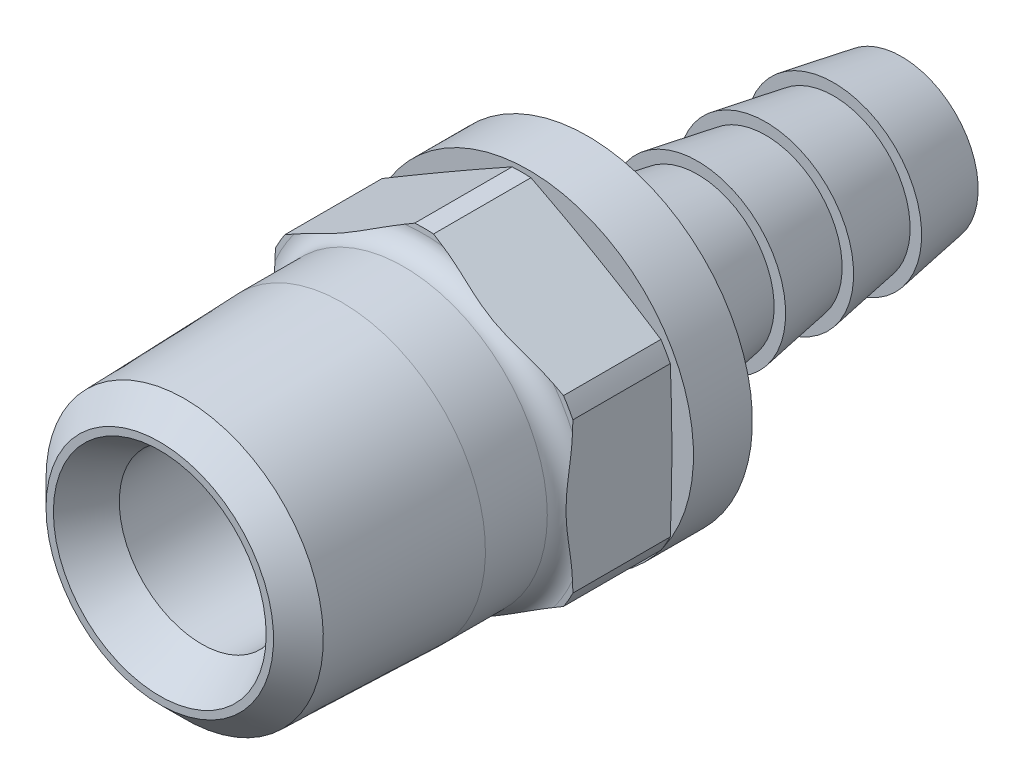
ISO-10303-21;
HEADER;
FILE_DESCRIPTION(('STEP AP214'),'2;1');
FILE_NAME('part.step','',(''),(''),'','','');
FILE_SCHEMA(('AUTOMOTIVE_DESIGN { 1 0 10303 214 1 1 1 1 }'));
ENDSEC;
DATA;
#1=APPLICATION_CONTEXT('core data for automotive mechanical design processes');
#2=APPLICATION_PROTOCOL_DEFINITION('international standard','automotive_design',2000,#1);
#3=PRODUCT_CONTEXT('',#1,'mechanical');
#4=PRODUCT('Part','Part','',(#3));
#5=PRODUCT_RELATED_PRODUCT_CATEGORY('part','',(#4));
#6=PRODUCT_DEFINITION_FORMATION('','',#4);
#7=PRODUCT_DEFINITION_CONTEXT('part definition',#1,'design');
#8=PRODUCT_DEFINITION('design','',#6,#7);
#9=PRODUCT_DEFINITION_SHAPE('','',#8);
#10=(LENGTH_UNIT() NAMED_UNIT(*) SI_UNIT(.MILLI.,.METRE.));
#11=(NAMED_UNIT(*) PLANE_ANGLE_UNIT() SI_UNIT($,.RADIAN.));
#12=(NAMED_UNIT(*) SI_UNIT($,.STERADIAN.) SOLID_ANGLE_UNIT());
#13=UNCERTAINTY_MEASURE_WITH_UNIT(LENGTH_MEASURE(1.E-05),#10,'distance_accuracy_value','');
#14=(GEOMETRIC_REPRESENTATION_CONTEXT(3) GLOBAL_UNCERTAINTY_ASSIGNED_CONTEXT((#13)) GLOBAL_UNIT_ASSIGNED_CONTEXT((#10,
#11,#12)) REPRESENTATION_CONTEXT('',''));
#15=CARTESIAN_POINT('',(0.,0.,0.));
#16=DIRECTION('',(0.,0.,1.));
#17=DIRECTION('',(1.,0.,0.));
#18=AXIS2_PLACEMENT_3D('',#15,#16,#17);
#19=CARTESIAN_POINT('',(0.,0.,-41.817726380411));
#20=DIRECTION('',(0.,0.,-1.));
#21=DIRECTION('',(-1.,0.,0.));
#22=AXIS2_PLACEMENT_3D('',#19,#20,#21);
#23=PLANE('',#22);
#24=CARTESIAN_POINT('',(0.,0.,-41.817726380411));
#25=DIRECTION('',(0.,0.,-1.));
#26=DIRECTION('',(-1.,0.,0.));
#27=AXIS2_PLACEMENT_3D('',#24,#25,#26);
#28=CIRCLE('',#27,5.1562);
#29=CARTESIAN_POINT('',(-5.1562,0.,-41.817726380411));
#30=VERTEX_POINT('',#29);
#31=EDGE_CURVE('E10',#30,#30,#28,.F.);
#32=ORIENTED_EDGE('',*,*,#31,.T.);
#33=EDGE_LOOP('',(#32));
#34=FACE_BOUND('',#33,.T.);
#35=CARTESIAN_POINT('',(0.,0.,-41.817726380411));
#36=DIRECTION('',(0.,0.,-1.));
#37=DIRECTION('',(-1.,0.,0.));
#38=AXIS2_PLACEMENT_3D('',#35,#36,#37);
#39=CIRCLE('',#38,5.715);
#40=CARTESIAN_POINT('',(-5.715,0.,-41.817726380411));
#41=VERTEX_POINT('',#40);
#42=EDGE_CURVE('E590',#41,#41,#39,.T.);
#43=ORIENTED_EDGE('',*,*,#42,.T.);
#44=EDGE_LOOP('',(#43));
#45=FACE_BOUND('',#44,.T.);
#46=ADVANCED_FACE('F15',(#34,#45),#23,.T.);
#47=CARTESIAN_POINT('',(0.,0.,-13.9677263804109));
#48=DIRECTION('',(0.,0.,-1.));
#49=DIRECTION('',(-1.,0.,0.));
#50=AXIS2_PLACEMENT_3D('',#47,#48,#49);
#51=PLANE('',#50);
#52=CARTESIAN_POINT('',(0.,0.,-13.9677263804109));
#53=DIRECTION('',(0.,0.,1.));
#54=DIRECTION('',(1.,0.,0.));
#55=AXIS2_PLACEMENT_3D('',#52,#53,#54);
#56=CIRCLE('',#55,7.30893530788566);
#57=CARTESIAN_POINT('',(7.30893530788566,0.,-13.9677263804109));
#58=VERTEX_POINT('',#57);
#59=EDGE_CURVE('E19',#58,#58,#56,.F.);
#60=ORIENTED_EDGE('',*,*,#59,.T.);
#61=EDGE_LOOP('',(#60));
#62=FACE_BOUND('',#61,.T.);
#63=CARTESIAN_POINT('',(0.,0.,-13.9677263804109));
#64=DIRECTION('',(0.,0.,-1.));
#65=DIRECTION('',(-1.,0.,0.));
#66=AXIS2_PLACEMENT_3D('',#63,#64,#65);
#67=CIRCLE('',#66,12.3);
#68=CARTESIAN_POINT('',(-12.3,0.,-13.9677263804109));
#69=VERTEX_POINT('',#68);
#70=EDGE_CURVE('E300',#69,#69,#67,.T.);
#71=ORIENTED_EDGE('',*,*,#70,.F.);
#72=EDGE_LOOP('',(#71));
#73=FACE_BOUND('',#72,.T.);
#74=ADVANCED_FACE('F17',(#62,#73),#51,.F.);
#75=CARTESIAN_POINT('',(0.,0.,-14.2268485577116));
#76=DIRECTION('',(0.,0.,1.));
#77=DIRECTION('',(1.,0.,0.));
#78=AXIS2_PLACEMENT_3D('',#75,#76,#77);
#79=TOROIDAL_SURFACE('',#78,7.58825,0.380999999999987);
#80=ORIENTED_EDGE('',*,*,#59,.F.);
#81=EDGE_LOOP('',(#80));
#82=FACE_BOUND('',#81,.T.);
#83=CARTESIAN_POINT('',(0.,0.,-13.8472983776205));
#84=DIRECTION('',(0.,0.,1.));
#85=DIRECTION('',(0.,1.,0.));
#86=AXIS2_PLACEMENT_3D('',#83,#84,#85);
#87=CIRCLE('',#86,7.55504366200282);
#88=CARTESIAN_POINT('',(0.,7.55504366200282,-13.8472983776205));
#89=VERTEX_POINT('',#88);
#90=EDGE_CURVE('E296',#89,#89,#87,.T.);
#91=ORIENTED_EDGE('',*,*,#90,.F.);
#92=EDGE_LOOP('',(#91));
#93=FACE_BOUND('',#92,.T.);
#94=ADVANCED_FACE('F325',(#82,#93),#79,.F.);
#95=CARTESIAN_POINT('',(0.,0.,-13.9677263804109));
#96=DIRECTION('',(0.,0.,-1.));
#97=DIRECTION('',(-1.,0.,0.));
#98=AXIS2_PLACEMENT_3D('',#95,#96,#97);
#99=CYLINDRICAL_SURFACE('',#98,12.3);
#100=ORIENTED_EDGE('',*,*,#70,.T.);
#101=EDGE_LOOP('',(#100));
#102=FACE_BOUND('',#101,.T.);
#103=CARTESIAN_POINT('',(0.,0.,-18.367726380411));
#104=DIRECTION('',(0.,0.,-1.));
#105=DIRECTION('',(-1.,0.,0.));
#106=AXIS2_PLACEMENT_3D('',#103,#104,#105);
#107=CIRCLE('',#106,12.3);
#108=CARTESIAN_POINT('',(-12.3,0.,-18.367726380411));
#109=VERTEX_POINT('',#108);
#110=EDGE_CURVE('E141',#109,#109,#107,.T.);
#111=ORIENTED_EDGE('',*,*,#110,.F.);
#112=EDGE_LOOP('',(#111));
#113=FACE_BOUND('',#112,.T.);
#114=ADVANCED_FACE('F328',(#102,#113),#99,.T.);
#115=CARTESIAN_POINT('',(0.,0.,13.605073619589));
#116=DIRECTION('',(0.,0.,-1.));
#117=DIRECTION('',(-1.,0.,0.));
#118=AXIS2_PLACEMENT_3D('',#115,#116,#117);
#119=CYLINDRICAL_SURFACE('',#118,12.446);
#120=CARTESIAN_POINT('',(0.,0.,-13.41939514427));
#121=DIRECTION('',(0.,0.,1.));
#122=DIRECTION('',(0.,1.,0.));
#123=AXIS2_PLACEMENT_3D('',#120,#121,#122);
#124=CIRCLE('',#123,12.4459999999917);
#125=CARTESIAN_POINT('',(-10.4102632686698,-6.82124143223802,-13.4193951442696));
#126=VERTEX_POINT('',#125);
#127=CARTESIAN_POINT('',(-11.1125,-5.60493173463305,-13.41939514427));
#128=VERTEX_POINT('',#127);
#129=EDGE_CURVE('E304',#126,#128,#124,.F.);
#130=ORIENTED_EDGE('',*,*,#129,.F.);
#131=DIRECTION('',(0.,0.,1.));
#132=VECTOR('',#131,1.);
#133=CARTESIAN_POINT('',(-10.4102632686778,-6.82124143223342,13.605073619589));
#134=LINE('',#133,#132);
#135=CARTESIAN_POINT('',(-10.4102632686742,-6.82124143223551,-6.14549437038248));
#136=VERTEX_POINT('',#135);
#137=EDGE_CURVE('E157',#136,#126,#134,.F.);
#138=ORIENTED_EDGE('',*,*,#137,.F.);
#139=CARTESIAN_POINT('',(0.,0.,-6.14549437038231));
#140=DIRECTION('',(0.,0.,-1.));
#141=DIRECTION('',(0.,1.,0.));
#142=AXIS2_PLACEMENT_3D('',#139,#140,#141);
#143=CIRCLE('',#142,12.4459999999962);
#144=CARTESIAN_POINT('',(-11.1125,-5.60493173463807,-6.14549437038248));
#145=VERTEX_POINT('',#144);
#146=EDGE_CURVE('E320',#145,#136,#143,.F.);
#147=ORIENTED_EDGE('',*,*,#146,.F.);
#148=DIRECTION('',(0.,0.,1.));
#149=VECTOR('',#148,1.);
#150=CARTESIAN_POINT('',(-11.1125,-5.60493173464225,13.605073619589));
#151=LINE('',#150,#149);
#152=EDGE_CURVE('E285',#128,#145,#151,.T.);
#153=ORIENTED_EDGE('',*,*,#152,.F.);
#154=EDGE_LOOP('',(#130,#138,#147,#153));
#155=FACE_BOUND('',#154,.T.);
#156=ADVANCED_FACE('F332',(#155),#119,.T.);
#157=CARTESIAN_POINT('',(0.,0.,13.605073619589));
#158=DIRECTION('',(0.,0.,-1.));
#159=DIRECTION('',(-1.,0.,0.));
#160=AXIS2_PLACEMENT_3D('',#157,#158,#159);
#161=CYLINDRICAL_SURFACE('',#160,12.446);
#162=CARTESIAN_POINT('',(0.,0.,-13.41939514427));
#163=DIRECTION('',(0.,0.,1.));
#164=DIRECTION('',(0.,1.,0.));
#165=AXIS2_PLACEMENT_3D('',#162,#163,#164);
#166=CIRCLE('',#165,12.4459999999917);
#167=CARTESIAN_POINT('',(-11.1125,5.60493173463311,-13.4193951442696));
#168=VERTEX_POINT('',#167);
#169=CARTESIAN_POINT('',(-10.4102632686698,6.82124143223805,-13.41939514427));
#170=VERTEX_POINT('',#169);
#171=EDGE_CURVE('E295',#168,#170,#166,.F.);
#172=ORIENTED_EDGE('',*,*,#171,.F.);
#173=DIRECTION('',(0.,0.,1.));
#174=VECTOR('',#173,1.);
#175=CARTESIAN_POINT('',(-11.1125,5.60493173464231,13.605073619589));
#176=LINE('',#175,#174);
#177=CARTESIAN_POINT('',(-11.1125,5.60493173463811,-6.14549437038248));
#178=VERTEX_POINT('',#177);
#179=EDGE_CURVE('E290',#178,#168,#176,.F.);
#180=ORIENTED_EDGE('',*,*,#179,.F.);
#181=CARTESIAN_POINT('',(0.,0.,-6.14549437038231));
#182=DIRECTION('',(0.,0.,-1.));
#183=DIRECTION('',(0.,1.,0.));
#184=AXIS2_PLACEMENT_3D('',#181,#182,#183);
#185=CIRCLE('',#184,12.4459999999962);
#186=CARTESIAN_POINT('',(-10.4102632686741,6.82124143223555,-6.14549437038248));
#187=VERTEX_POINT('',#186);
#188=EDGE_CURVE('E284',#187,#178,#185,.F.);
#189=ORIENTED_EDGE('',*,*,#188,.F.);
#190=DIRECTION('',(0.,0.,1.));
#191=VECTOR('',#190,1.);
#192=CARTESIAN_POINT('',(-10.4102632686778,6.82124143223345,13.605073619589));
#193=LINE('',#192,#191);
#194=EDGE_CURVE('E278',#170,#187,#193,.T.);
#195=ORIENTED_EDGE('',*,*,#194,.F.);
#196=EDGE_LOOP('',(#172,#180,#189,#195));
#197=FACE_BOUND('',#196,.T.);
#198=ADVANCED_FACE('F336',(#197),#161,.T.);
#199=CARTESIAN_POINT('',(0.,0.,13.605073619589));
#200=DIRECTION('',(0.,0.,-1.));
#201=DIRECTION('',(-1.,0.,0.));
#202=AXIS2_PLACEMENT_3D('',#199,#200,#201);
#203=CYLINDRICAL_SURFACE('',#202,12.446);
#204=CARTESIAN_POINT('',(0.,0.,-13.41939514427));
#205=DIRECTION('',(0.,0.,1.));
#206=DIRECTION('',(0.,1.,0.));
#207=AXIS2_PLACEMENT_3D('',#204,#205,#206);
#208=CIRCLE('',#207,12.4459999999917);
#209=CARTESIAN_POINT('',(-0.702236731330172,12.4261731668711,-13.4193951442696));
#210=VERTEX_POINT('',#209);
#211=CARTESIAN_POINT('',(0.702236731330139,12.4261731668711,-13.41939514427));
#212=VERTEX_POINT('',#211);
#213=EDGE_CURVE('E299',#210,#212,#208,.F.);
#214=ORIENTED_EDGE('',*,*,#213,.F.);
#215=DIRECTION('',(0.,0.,1.));
#216=VECTOR('',#215,1.);
#217=CARTESIAN_POINT('',(-0.702236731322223,12.4261731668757,13.605073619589));
#218=LINE('',#217,#216);
#219=CARTESIAN_POINT('',(-0.702236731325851,12.4261731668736,-6.14549437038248));
#220=VERTEX_POINT('',#219);
#221=EDGE_CURVE('E282',#220,#210,#218,.F.);
#222=ORIENTED_EDGE('',*,*,#221,.F.);
#223=CARTESIAN_POINT('',(0.,0.,-6.14549437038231));
#224=DIRECTION('',(0.,0.,-1.));
#225=DIRECTION('',(0.,1.,0.));
#226=AXIS2_PLACEMENT_3D('',#223,#224,#225);
#227=CIRCLE('',#226,12.4459999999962);
#228=CARTESIAN_POINT('',(0.70223673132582,12.4261731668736,-6.14549437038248));
#229=VERTEX_POINT('',#228);
#230=EDGE_CURVE('E313',#229,#220,#227,.F.);
#231=ORIENTED_EDGE('',*,*,#230,.F.);
#232=DIRECTION('',(0.,0.,1.));
#233=VECTOR('',#232,1.);
#234=CARTESIAN_POINT('',(0.702236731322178,12.4261731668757,13.605073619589));
#235=LINE('',#234,#233);
#236=EDGE_CURVE('E271',#212,#229,#235,.T.);
#237=ORIENTED_EDGE('',*,*,#236,.F.);
#238=EDGE_LOOP('',(#214,#222,#231,#237));
#239=FACE_BOUND('',#238,.T.);
#240=ADVANCED_FACE('F340',(#239),#203,.T.);
#241=CARTESIAN_POINT('',(0.,0.,13.605073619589));
#242=DIRECTION('',(0.,0.,-1.));
#243=DIRECTION('',(-1.,0.,0.));
#244=AXIS2_PLACEMENT_3D('',#241,#242,#243);
#245=CYLINDRICAL_SURFACE('',#244,12.446);
#246=CARTESIAN_POINT('',(0.,0.,-13.41939514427));
#247=DIRECTION('',(0.,0.,1.));
#248=DIRECTION('',(0.,1.,0.));
#249=AXIS2_PLACEMENT_3D('',#246,#247,#248);
#250=CIRCLE('',#249,12.4459999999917);
#251=CARTESIAN_POINT('',(10.4102632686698,6.82124143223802,-13.4193951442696));
#252=VERTEX_POINT('',#251);
#253=CARTESIAN_POINT('',(11.1125,5.60493173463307,-13.41939514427));
#254=VERTEX_POINT('',#253);
#255=EDGE_CURVE('E305',#252,#254,#250,.F.);
#256=ORIENTED_EDGE('',*,*,#255,.F.);
#257=DIRECTION('',(0.,0.,1.));
#258=VECTOR('',#257,1.);
#259=CARTESIAN_POINT('',(10.4102632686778,6.82124143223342,13.605073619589));
#260=LINE('',#259,#258);
#261=CARTESIAN_POINT('',(10.4102632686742,6.82124143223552,-6.14549437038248));
#262=VERTEX_POINT('',#261);
#263=EDGE_CURVE('E275',#262,#252,#260,.F.);
#264=ORIENTED_EDGE('',*,*,#263,.F.);
#265=CARTESIAN_POINT('',(0.,0.,-6.14549437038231));
#266=DIRECTION('',(0.,0.,-1.));
#267=DIRECTION('',(0.,1.,0.));
#268=AXIS2_PLACEMENT_3D('',#265,#266,#267);
#269=CIRCLE('',#268,12.4459999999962);
#270=CARTESIAN_POINT('',(11.1125,5.60493173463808,-6.14549437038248));
#271=VERTEX_POINT('',#270);
#272=EDGE_CURVE('E310',#271,#262,#269,.F.);
#273=ORIENTED_EDGE('',*,*,#272,.F.);
#274=DIRECTION('',(0.,0.,1.));
#275=VECTOR('',#274,1.);
#276=CARTESIAN_POINT('',(11.1125,5.60493173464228,13.605073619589));
#277=LINE('',#276,#275);
#278=EDGE_CURVE('E263',#254,#271,#277,.T.);
#279=ORIENTED_EDGE('',*,*,#278,.F.);
#280=EDGE_LOOP('',(#256,#264,#273,#279));
#281=FACE_BOUND('',#280,.T.);
#282=ADVANCED_FACE('F344',(#281),#245,.T.);
#283=CARTESIAN_POINT('',(0.,0.,13.605073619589));
#284=DIRECTION('',(0.,0.,-1.));
#285=DIRECTION('',(-1.,0.,0.));
#286=AXIS2_PLACEMENT_3D('',#283,#284,#285);
#287=CYLINDRICAL_SURFACE('',#286,12.446);
#288=CARTESIAN_POINT('',(0.,0.,-13.41939514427));
#289=DIRECTION('',(0.,0.,1.));
#290=DIRECTION('',(0.,1.,0.));
#291=AXIS2_PLACEMENT_3D('',#288,#289,#290);
#292=CIRCLE('',#291,12.4459999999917);
#293=CARTESIAN_POINT('',(0.702236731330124,-12.4261731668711,-13.4193951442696));
#294=VERTEX_POINT('',#293);
#295=CARTESIAN_POINT('',(-0.702236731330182,-12.4261731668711,-13.41939514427));
#296=VERTEX_POINT('',#295);
#297=EDGE_CURVE('E303',#294,#296,#292,.F.);
#298=ORIENTED_EDGE('',*,*,#297,.F.);
#299=DIRECTION('',(0.,0.,1.));
#300=VECTOR('',#299,1.);
#301=CARTESIAN_POINT('',(0.702236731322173,-12.4261731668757,13.605073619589));
#302=LINE('',#301,#300);
#303=CARTESIAN_POINT('',(0.702236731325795,-12.4261731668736,-6.14549437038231));
#304=VERTEX_POINT('',#303);
#305=EDGE_CURVE('E135',#304,#294,#302,.F.);
#306=ORIENTED_EDGE('',*,*,#305,.F.);
#307=CARTESIAN_POINT('',(0.,0.,-6.14549437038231));
#308=DIRECTION('',(0.,0.,-1.));
#309=DIRECTION('',(0.,1.,0.));
#310=AXIS2_PLACEMENT_3D('',#307,#308,#309);
#311=CIRCLE('',#310,12.4459999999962);
#312=CARTESIAN_POINT('',(-0.702236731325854,-12.4261731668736,-6.14549437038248));
#313=VERTEX_POINT('',#312);
#314=EDGE_CURVE('E128',#313,#304,#311,.F.);
#315=ORIENTED_EDGE('',*,*,#314,.F.);
#316=DIRECTION('',(0.,0.,1.));
#317=VECTOR('',#316,1.);
#318=CARTESIAN_POINT('',(-0.702236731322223,-12.4261731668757,13.605073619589));
#319=LINE('',#318,#317);
#320=EDGE_CURVE('E132',#296,#313,#319,.T.);
#321=ORIENTED_EDGE('',*,*,#320,.F.);
#322=EDGE_LOOP('',(#298,#306,#315,#321));
#323=FACE_BOUND('',#322,.T.);
#324=ADVANCED_FACE('F131',(#323),#287,.T.);
#325=CARTESIAN_POINT('',(0.,0.,-13.41939514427));
#326=DIRECTION('',(0.,0.,1.));
#327=DIRECTION('',(1.,0.,0.));
#328=AXIS2_PLACEMENT_3D('',#325,#326,#327);
#329=CONICAL_SURFACE('',#328,12.4459999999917,1.4835298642);
#330=ORIENTED_EDGE('',*,*,#171,.T.);
#331=CARTESIAN_POINT('',(-0.702236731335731,12.4261731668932,-13.4193951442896));
#332=CARTESIAN_POINT('',(-1.10661685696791,12.1927041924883,-13.4378038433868));
#333=CARTESIAN_POINT('',(-1.5110644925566,11.9591962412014,-13.4543625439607));
#334=CARTESIAN_POINT('',(-2.32008220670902,11.4921096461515,-13.4832737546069));
#335=CARTESIAN_POINT('',(-2.72465228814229,11.2585310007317,-13.4956261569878));
#336=CARTESIAN_POINT('',(-3.53370520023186,10.7914240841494,-13.5156132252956));
#337=CARTESIAN_POINT('',(-3.93818799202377,10.5578958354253,-13.5232499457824));
#338=CARTESIAN_POINT('',(-4.74719718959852,10.0908141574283,-13.5334739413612));
#339=CARTESIAN_POINT('',(-5.15172359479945,9.85726072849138,-13.5360612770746));
#340=CARTESIAN_POINT('',(-5.96077640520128,9.39015387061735,-13.5360612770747));
#341=CARTESIAN_POINT('',(-6.36530281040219,9.15660044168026,-13.5334739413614));
#342=CARTESIAN_POINT('',(-7.17431200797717,8.68951876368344,-13.5232499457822));
#343=CARTESIAN_POINT('',(-7.57879479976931,8.45599051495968,-13.5156132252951));
#344=CARTESIAN_POINT('',(-8.38784771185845,7.98888359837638,-13.4956261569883));
#345=CARTESIAN_POINT('',(-8.79241779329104,7.7553049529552,-13.4832737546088));
#346=CARTESIAN_POINT('',(-9.60143550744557,7.2882183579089,-13.4543625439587));
#347=CARTESIAN_POINT('',(-10.005883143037,7.05471040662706,-13.4378038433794));
#348=CARTESIAN_POINT('',(-10.4102632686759,6.82124143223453,-13.4193951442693));
#349=B_SPLINE_CURVE_WITH_KNOTS('',3,(#331,#332,#333,#334,#335,#336,#337,#338,#339,#340,#341,
#342,#343,#344,#345,#346,#347,#348),.UNSPECIFIED.,.F.,.F.,(4,2,2,2,2,2,2,2,4),(0.,
1.40190591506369,2.80384771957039,4.20517828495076,5.60649202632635,7.00780576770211,
8.40913633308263,9.81107813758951,11.2129840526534),.UNSPECIFIED.);
#350=EDGE_CURVE('E281',#210,#170,#349,.T.);
#351=ORIENTED_EDGE('',*,*,#350,.F.);
#352=ORIENTED_EDGE('',*,*,#213,.T.);
#353=CARTESIAN_POINT('',(10.4102632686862,6.82124143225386,-13.4193951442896));
#354=CARTESIAN_POINT('',(10.00588314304,7.05471040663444,-13.4378038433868));
#355=CARTESIAN_POINT('',(9.60143550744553,7.28821835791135,-13.4543625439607));
#356=CARTESIAN_POINT('',(8.79241779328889,7.755304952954,-13.4832737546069));
#357=CARTESIAN_POINT('',(8.38784771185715,7.98888359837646,-13.4956261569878));
#358=CARTESIAN_POINT('',(7.57879479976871,8.45599051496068,-13.5156132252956));
#359=CARTESIAN_POINT('',(7.17431200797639,8.68951876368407,-13.5232499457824));
#360=CARTESIAN_POINT('',(6.36530281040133,9.15660044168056,-13.5334739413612));
#361=CARTESIAN_POINT('',(5.96077640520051,9.3901538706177,-13.5360612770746));
#362=CARTESIAN_POINT('',(5.15172359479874,9.85726072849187,-13.5360612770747));
#363=CARTESIAN_POINT('',(4.7471971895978,10.0908141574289,-13.5334739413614));
#364=CARTESIAN_POINT('',(3.93818799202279,10.5578958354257,-13.5232499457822));
#365=CARTESIAN_POINT('',(3.53370520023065,10.7914240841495,-13.5156132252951));
#366=CARTESIAN_POINT('',(2.72465228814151,11.2585310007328,-13.4956261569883));
#367=CARTESIAN_POINT('',(2.32008220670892,11.492109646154,-13.4832737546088));
#368=CARTESIAN_POINT('',(1.51106449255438,11.9591962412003,-13.4543625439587));
#369=CARTESIAN_POINT('',(1.10661685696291,12.1927041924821,-13.4378038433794));
#370=CARTESIAN_POINT('',(0.702236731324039,12.4261731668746,-13.4193951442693));
#371=B_SPLINE_CURVE_WITH_KNOTS('',3,(#353,#354,#355,#356,#357,#358,#359,#360,#361,#362,#363,
#364,#365,#366,#367,#368,#369,#370),.UNSPECIFIED.,.F.,.F.,(4,2,2,2,2,2,2,2,4),(0.,
1.4019059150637,2.80384771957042,4.2051782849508,5.6064920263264,7.00780576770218,
8.40913633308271,9.8110781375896,11.2129840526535),.UNSPECIFIED.);
#372=EDGE_CURVE('E274',#252,#212,#371,.T.);
#373=ORIENTED_EDGE('',*,*,#372,.F.);
#374=ORIENTED_EDGE('',*,*,#255,.T.);
#375=CARTESIAN_POINT('',(11.1125000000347,-5.60493173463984,-13.4193951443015));
#376=CARTESIAN_POINT('',(11.1125000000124,-5.13799378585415,-13.437803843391));
#377=CARTESIAN_POINT('',(11.1125000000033,-4.67097788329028,-13.4543625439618));
#378=CARTESIAN_POINT('',(11.1124999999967,-3.73680469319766,-13.4832737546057));
#379=CARTESIAN_POINT('',(11.1124999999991,-3.26964740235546,-13.4956261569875));
#380=CARTESIAN_POINT('',(11.1125000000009,-2.33543356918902,-13.5156132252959));
#381=CARTESIAN_POINT('',(11.1125000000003,-1.86837707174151,-13.5232499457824));
#382=CARTESIAN_POINT('',(11.1124999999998,-0.934213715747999,-13.5334739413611));
#383=CARTESIAN_POINT('',(11.1125,-0.467106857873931,-13.5360612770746));
#384=CARTESIAN_POINT('',(11.1125000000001,0.4671068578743,-13.5360612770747));
#385=CARTESIAN_POINT('',(11.1125,0.934213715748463,-13.5334739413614));
#386=CARTESIAN_POINT('',(11.1125,1.86837707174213,-13.5232499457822));
#387=CARTESIAN_POINT('',(11.1125,2.3354335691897,-13.5156132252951));
#388=CARTESIAN_POINT('',(11.1125,3.26964740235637,-13.4956261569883));
#389=CARTESIAN_POINT('',(11.1125,3.73680469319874,-13.4832737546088));
#390=CARTESIAN_POINT('',(11.1125,4.67097788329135,-13.4543625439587));
#391=CARTESIAN_POINT('',(11.1125,5.13799378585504,-13.4378038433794));
#392=CARTESIAN_POINT('',(11.1125,5.60493173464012,-13.4193951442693));
#393=B_SPLINE_CURVE_WITH_KNOTS('',3,(#375,#376,#377,#378,#379,#380,#381,#382,#383,#384,#385,
#386,#387,#388,#389,#390,#391,#392),.UNSPECIFIED.,.F.,.F.,(4,2,2,2,2,2,2,2,4),(0.,
1.40190591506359,2.80384771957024,4.20517828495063,5.60649202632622,7.00780576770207,
8.4091363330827,9.81107813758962,11.2129840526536),.UNSPECIFIED.);
#394=CARTESIAN_POINT('',(11.1125,-5.60493173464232,-13.4193951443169));
#395=VERTEX_POINT('',#394);
#396=EDGE_CURVE('E266',#395,#254,#393,.T.);
#397=ORIENTED_EDGE('',*,*,#396,.F.);
#398=CARTESIAN_POINT('',(0.,0.,-13.4193951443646));
#399=DIRECTION('',(0.,0.,-1.));
#400=DIRECTION('',(-1.,0.,0.));
#401=AXIS2_PLACEMENT_3D('',#398,#399,#400);
#402=CIRCLE('',#401,12.446);
#403=CARTESIAN_POINT('',(10.4102632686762,-6.82124143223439,-13.419395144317));
#404=VERTEX_POINT('',#403);
#405=EDGE_CURVE('E293',#404,#395,#402,.F.);
#406=ORIENTED_EDGE('',*,*,#405,.F.);
#407=CARTESIAN_POINT('',(0.702236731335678,-12.4261731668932,-13.4193951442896));
#408=CARTESIAN_POINT('',(1.1066168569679,-12.1927041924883,-13.4378038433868));
#409=CARTESIAN_POINT('',(1.51106449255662,-11.9591962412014,-13.4543625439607));
#410=CARTESIAN_POINT('',(2.32008220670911,-11.4921096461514,-13.4832737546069));
#411=CARTESIAN_POINT('',(2.72465228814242,-11.2585310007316,-13.4956261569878));
#412=CARTESIAN_POINT('',(3.53370520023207,-10.7914240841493,-13.5156132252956));
#413=CARTESIAN_POINT('',(3.938187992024,-10.5578958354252,-13.5232499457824));
#414=CARTESIAN_POINT('',(4.74719718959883,-10.0908141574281,-13.5334739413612));
#415=CARTESIAN_POINT('',(5.15172359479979,-9.85726072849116,-13.5360612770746));
#416=CARTESIAN_POINT('',(5.9607764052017,-9.39015387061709,-13.5360612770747));
#417=CARTESIAN_POINT('',(6.36530281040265,-9.15660044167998,-13.5334739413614));
#418=CARTESIAN_POINT('',(7.17431200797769,-8.68951876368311,-13.5232499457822));
#419=CARTESIAN_POINT('',(7.57879479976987,-8.45599051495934,-13.5156132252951));
#420=CARTESIAN_POINT('',(8.38784771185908,-7.98888359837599,-13.4956261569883));
#421=CARTESIAN_POINT('',(8.79241779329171,-7.75530495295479,-13.4832737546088));
#422=CARTESIAN_POINT('',(9.60143550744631,-7.28821835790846,-13.4543625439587));
#423=CARTESIAN_POINT('',(10.0058831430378,-7.0547104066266,-13.4378038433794));
#424=CARTESIAN_POINT('',(10.4102632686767,-6.82124143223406,-13.4193951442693));
#425=B_SPLINE_CURVE_WITH_KNOTS('',3,(#407,#408,#409,#410,#411,#412,#413,#414,#415,#416,#417,
#418,#419,#420,#421,#422,#423,#424),.UNSPECIFIED.,.F.,.F.,(4,2,2,2,2,2,2,2,4),(0.,
1.40190591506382,2.80384771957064,4.20517828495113,5.60649202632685,7.00780576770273,
8.40913633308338,9.81107813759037,11.2129840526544),.UNSPECIFIED.);
#426=EDGE_CURVE('E188',#294,#404,#425,.T.);
#427=ORIENTED_EDGE('',*,*,#426,.F.);
#428=ORIENTED_EDGE('',*,*,#297,.T.);
#429=CARTESIAN_POINT('',(-10.4102632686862,-6.82124143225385,-13.4193951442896));
#430=CARTESIAN_POINT('',(-10.00588314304,-7.05471040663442,-13.4378038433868));
#431=CARTESIAN_POINT('',(-9.60143550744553,-7.28821835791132,-13.4543625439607));
#432=CARTESIAN_POINT('',(-8.79241779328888,-7.75530495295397,-13.4832737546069));
#433=CARTESIAN_POINT('',(-8.38784771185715,-7.98888359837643,-13.4956261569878));
#434=CARTESIAN_POINT('',(-7.57879479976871,-8.45599051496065,-13.5156132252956));
#435=CARTESIAN_POINT('',(-7.17431200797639,-8.68951876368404,-13.5232499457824));
#436=CARTESIAN_POINT('',(-6.36530281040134,-9.15660044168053,-13.5334739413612));
#437=CARTESIAN_POINT('',(-5.96077640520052,-9.39015387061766,-13.5360612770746));
#438=CARTESIAN_POINT('',(-5.15172359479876,-9.85726072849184,-13.5360612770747));
#439=CARTESIAN_POINT('',(-4.74719718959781,-10.0908141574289,-13.5334739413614));
#440=CARTESIAN_POINT('',(-3.93818799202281,-10.5578958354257,-13.5232499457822));
#441=CARTESIAN_POINT('',(-3.53370520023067,-10.7914240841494,-13.5156132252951));
#442=CARTESIAN_POINT('',(-2.72465228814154,-11.2585310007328,-13.4956261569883));
#443=CARTESIAN_POINT('',(-2.32008220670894,-11.4921096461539,-13.4832737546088));
#444=CARTESIAN_POINT('',(-1.51106449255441,-11.9591962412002,-13.4543625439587));
#445=CARTESIAN_POINT('',(-1.10661685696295,-12.1927041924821,-13.4378038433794));
#446=CARTESIAN_POINT('',(-0.702236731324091,-12.4261731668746,-13.4193951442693));
#447=B_SPLINE_CURVE_WITH_KNOTS('',3,(#429,#430,#431,#432,#433,#434,#435,#436,#437,#438,#439,
#440,#441,#442,#443,#444,#445,#446),.UNSPECIFIED.,.F.,.F.,(4,2,2,2,2,2,2,2,4),(0.,
1.4019059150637,2.80384771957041,4.20517828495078,5.60649202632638,7.00780576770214,
8.40913633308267,9.81107813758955,11.2129840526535),.UNSPECIFIED.);
#448=EDGE_CURVE('E150',#126,#296,#447,.T.);
#449=ORIENTED_EDGE('',*,*,#448,.F.);
#450=ORIENTED_EDGE('',*,*,#129,.T.);
#451=CARTESIAN_POINT('',(-11.1125000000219,5.60493173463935,-13.4193951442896));
#452=CARTESIAN_POINT('',(-11.1125000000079,5.13799378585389,-13.4378038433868));
#453=CARTESIAN_POINT('',(-11.1125000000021,4.6709778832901,-13.4543625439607));
#454=CARTESIAN_POINT('',(-11.1124999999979,3.7368046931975,-13.4832737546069));
#455=CARTESIAN_POINT('',(-11.1124999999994,3.26964740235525,-13.4956261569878));
#456=CARTESIAN_POINT('',(-11.1125000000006,2.33543356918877,-13.5156132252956));
#457=CARTESIAN_POINT('',(-11.1125000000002,1.86837707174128,-13.5232499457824));
#458=CARTESIAN_POINT('',(-11.1124999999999,0.934213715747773,-13.5334739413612));
#459=CARTESIAN_POINT('',(-11.1125,0.4671068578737,-13.5360612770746));
#460=CARTESIAN_POINT('',(-11.1125000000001,-0.467106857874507,-13.5360612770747));
#461=CARTESIAN_POINT('',(-11.1125,-0.93421371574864,-13.5334739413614));
#462=CARTESIAN_POINT('',(-11.1125,-1.86837707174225,-13.5232499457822));
#463=CARTESIAN_POINT('',(-11.1125,-2.33543356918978,-13.5156132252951));
#464=CARTESIAN_POINT('',(-11.1125,-3.2696474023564,-13.4956261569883));
#465=CARTESIAN_POINT('',(-11.1125,-3.73680469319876,-13.4832737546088));
#466=CARTESIAN_POINT('',(-11.1125,-4.67097788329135,-13.4543625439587));
#467=CARTESIAN_POINT('',(-11.1125,-5.13799378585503,-13.4378038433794));
#468=CARTESIAN_POINT('',(-11.1125,-5.6049317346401,-13.4193951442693));
#469=B_SPLINE_CURVE_WITH_KNOTS('',3,(#451,#452,#453,#454,#455,#456,#457,#458,#459,#460,#461,
#462,#463,#464,#465,#466,#467,#468),.UNSPECIFIED.,.F.,.F.,(4,2,2,2,2,2,2,2,4),(0.,
1.4019059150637,2.80384771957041,4.20517828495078,5.60649202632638,7.00780576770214,
8.40913633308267,9.81107813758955,11.2129840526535),.UNSPECIFIED.);
#470=EDGE_CURVE('E289',#168,#128,#469,.T.);
#471=ORIENTED_EDGE('',*,*,#470,.F.);
#472=EDGE_LOOP('',(#330,#351,#352,#373,#374,#397,#406,#427,#428,#449,#450,#471));
#473=FACE_BOUND('',#472,.T.);
#474=ORIENTED_EDGE('',*,*,#90,.T.);
#475=EDGE_LOOP('',(#474));
#476=FACE_BOUND('',#475,.T.);
#477=ADVANCED_FACE('F350',(#473,#476),#329,.T.);
#478=CARTESIAN_POINT('',(0.,0.,13.605073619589));
#479=DIRECTION('',(0.,0.,-1.));
#480=DIRECTION('',(-1.,0.,0.));
#481=AXIS2_PLACEMENT_3D('',#478,#479,#480);
#482=CYLINDRICAL_SURFACE('',#481,12.446);
#483=ORIENTED_EDGE('',*,*,#405,.T.);
#484=DIRECTION('',(0.,0.,1.));
#485=VECTOR('',#484,1.);
#486=CARTESIAN_POINT('',(11.1125,-5.60493173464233,13.605073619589));
#487=LINE('',#486,#485);
#488=CARTESIAN_POINT('',(11.1125,-5.60493173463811,-6.14549437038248));
#489=VERTEX_POINT('',#488);
#490=EDGE_CURVE('E267',#489,#395,#487,.F.);
#491=ORIENTED_EDGE('',*,*,#490,.F.);
#492=CARTESIAN_POINT('',(0.,0.,-6.14549437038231));
#493=DIRECTION('',(0.,0.,-1.));
#494=DIRECTION('',(0.,1.,0.));
#495=AXIS2_PLACEMENT_3D('',#492,#493,#494);
#496=CIRCLE('',#495,12.4459999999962);
#497=CARTESIAN_POINT('',(10.4102632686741,-6.82124143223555,-6.14549437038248));
#498=VERTEX_POINT('',#497);
#499=EDGE_CURVE('E307',#498,#489,#496,.F.);
#500=ORIENTED_EDGE('',*,*,#499,.F.);
#501=DIRECTION('',(0.,0.,1.));
#502=VECTOR('',#501,1.);
#503=CARTESIAN_POINT('',(10.4102632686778,-6.82124143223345,13.605073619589));
#504=LINE('',#503,#502);
#505=EDGE_CURVE('E260',#404,#498,#504,.T.);
#506=ORIENTED_EDGE('',*,*,#505,.F.);
#507=EDGE_LOOP('',(#483,#491,#500,#506));
#508=FACE_BOUND('',#507,.T.);
#509=ADVANCED_FACE('F353',(#508),#482,.T.);
#510=CARTESIAN_POINT('',(0.,0.,-18.367726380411));
#511=DIRECTION('',(0.,0.,-1.));
#512=DIRECTION('',(-1.,0.,0.));
#513=AXIS2_PLACEMENT_3D('',#510,#511,#512);
#514=PLANE('',#513);
#515=ORIENTED_EDGE('',*,*,#110,.T.);
#516=EDGE_LOOP('',(#515));
#517=FACE_BOUND('',#516,.T.);
#518=CARTESIAN_POINT('',(0.,0.,-18.367726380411));
#519=DIRECTION('',(0.,0.,1.));
#520=DIRECTION('',(1.,0.,0.));
#521=AXIS2_PLACEMENT_3D('',#518,#519,#520);
#522=CIRCLE('',#521,11.1);
#523=CARTESIAN_POINT('',(11.1,0.,-18.367726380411));
#524=VERTEX_POINT('',#523);
#525=EDGE_CURVE('E259',#524,#524,#522,.T.);
#526=ORIENTED_EDGE('',*,*,#525,.T.);
#527=EDGE_LOOP('',(#526));
#528=FACE_BOUND('',#527,.T.);
#529=ADVANCED_FACE('F177',(#517,#528),#514,.T.);
#530=CARTESIAN_POINT('',(0.,0.,-6.14549437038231));
#531=DIRECTION('',(0.,0.,-1.));
#532=DIRECTION('',(-1.,0.,0.));
#533=AXIS2_PLACEMENT_3D('',#530,#531,#532);
#534=CONICAL_SURFACE('',#533,12.4459999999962,1.48352986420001);
#535=CARTESIAN_POINT('',(-0.702236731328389,-12.4261731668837,-6.14549437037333));
#536=CARTESIAN_POINT('',(-0.82227326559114,-12.3568700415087,-6.14002845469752));
#537=CARTESIAN_POINT('',(-0.94231520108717,-12.2875637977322,-6.13473110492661));
#538=CARTESIAN_POINT('',(-1.18240987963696,-12.1489450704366,-6.12447353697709));
#539=CARTESIAN_POINT('',(-1.30246262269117,-12.0796325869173,-6.11951331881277));
#540=CARTESIAN_POINT('',(-1.42252076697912,-12.0103169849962,-6.11472166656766));
#541=B_SPLINE_CURVE_WITH_KNOTS('',3,(#535,#536,#537,#538,#539,#540),.UNSPECIFIED.,.F.,.F.,(4,2,
4),(0.,0.416141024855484,0.832282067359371),.UNSPECIFIED.);
#542=CARTESIAN_POINT('',(-1.42252076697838,-12.0103169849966,-6.11472166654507));
#543=VERTEX_POINT('',#542);
#544=EDGE_CURVE('E140',#313,#543,#541,.T.);
#545=ORIENTED_EDGE('',*,*,#544,.F.);
#546=ORIENTED_EDGE('',*,*,#314,.T.);
#547=CARTESIAN_POINT('',(1.42252076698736,-12.0103169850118,-6.11472166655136));
#548=CARTESIAN_POINT('',(1.30246262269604,-12.0796325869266,-6.11951331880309));
#549=CARTESIAN_POINT('',(1.18240987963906,-12.1489450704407,-6.12447353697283));
#550=CARTESIAN_POINT('',(0.942315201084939,-12.2875637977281,-6.13473110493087));
#551=CARTESIAN_POINT('',(0.822273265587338,-12.3568700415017,-6.14002845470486));
#552=CARTESIAN_POINT('',(0.702236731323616,-12.4261731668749,-6.14549437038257));
#553=B_SPLINE_CURVE_WITH_KNOTS('',3,(#547,#548,#549,#550,#551,#552),.UNSPECIFIED.,.F.,.F.,(4,2,
4),(0.,0.416141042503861,0.832282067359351),.UNSPECIFIED.);
#554=CARTESIAN_POINT('',(1.42252076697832,-12.0103169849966,-6.11472166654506));
#555=VERTEX_POINT('',#554);
#556=EDGE_CURVE('E181',#555,#304,#553,.T.);
#557=ORIENTED_EDGE('',*,*,#556,.F.);
#558=CARTESIAN_POINT('',(0.,0.,-6.11472166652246));
#559=DIRECTION('',(0.,0.,-1.));
#560=DIRECTION('',(-1.,0.,0.));
#561=AXIS2_PLACEMENT_3D('',#558,#559,#560);
#562=CIRCLE('',#561,12.0942663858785);
#563=EDGE_CURVE('E156',#555,#543,#562,.T.);
#564=ORIENTED_EDGE('',*,*,#563,.T.);
#565=EDGE_LOOP('',(#545,#546,#557,#564));
#566=FACE_BOUND('',#565,.T.);
#567=ADVANCED_FACE('F154',(#566),#534,.T.);
#568=CARTESIAN_POINT('',(-11.1125,-6.41580486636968,13.605073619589));
#569=DIRECTION('',(-0.5,-0.866025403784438,0.));
#570=DIRECTION('',(0.866025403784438,-0.5,0.));
#571=AXIS2_PLACEMENT_3D('',#568,#569,#570);
#572=PLANE('',#571);
#573=ORIENTED_EDGE('',*,*,#448,.T.);
#574=ORIENTED_EDGE('',*,*,#320,.T.);
#575=ORIENTED_EDGE('',*,*,#544,.T.);
#576=CARTESIAN_POINT('',(-1.4225207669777,-12.010316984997,-6.11472166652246));
#577=CARTESIAN_POINT('',(-1.53138242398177,-11.9474656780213,-6.11036892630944));
#578=CARTESIAN_POINT('',(-1.64015087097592,-11.8846681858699,-6.10370094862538));
#579=CARTESIAN_POINT('',(-1.85721237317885,-11.7593476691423,-6.08654854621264));
#580=CARTESIAN_POINT('',(-1.96550594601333,-11.6968243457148,-6.07607299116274));
#581=CARTESIAN_POINT('',(-2.18171630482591,-11.5719952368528,-6.05210489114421));
#582=CARTESIAN_POINT('',(-2.28963337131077,-11.5096892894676,-6.0386156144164));
#583=CARTESIAN_POINT('',(-2.50520022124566,-11.3852317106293,-6.00934703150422));
#584=CARTESIAN_POINT('',(-2.612850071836,-11.3230800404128,-5.99356837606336));
#585=CARTESIAN_POINT('',(-2.8280724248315,-11.1988213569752,-5.96042385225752));
#586=CARTESIAN_POINT('',(-2.93564474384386,-11.136714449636,-5.94305642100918));
#587=CARTESIAN_POINT('',(-3.15072783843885,-11.0125361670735,-5.90747609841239));
#588=CARTESIAN_POINT('',(-3.25823857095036,-10.9504648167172,-5.889262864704));
#589=CARTESIAN_POINT('',(-3.47330612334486,-10.8262955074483,-5.85275901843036));
#590=CARTESIAN_POINT('',(-3.5808629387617,-10.7641975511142,-5.83446837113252));
#591=CARTESIAN_POINT('',(-3.7961368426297,-10.6399091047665,-5.79862940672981));
#592=CARTESIAN_POINT('',(-3.90385398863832,-10.5777185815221,-5.78108154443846));
#593=CARTESIAN_POINT('',(-4.13264951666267,-10.4456234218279,-5.74557064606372));
#594=CARTESIAN_POINT('',(-4.25375302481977,-10.3757042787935,-5.72781864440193));
#595=CARTESIAN_POINT('',(-4.49626539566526,-10.2356896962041,-5.69564982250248));
#596=CARTESIAN_POINT('',(-4.61767416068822,-10.1655943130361,-5.68123204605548));
#597=CARTESIAN_POINT('',(-4.86073515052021,-10.0252629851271,-5.65695324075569));
#598=CARTESIAN_POINT('',(-4.98238706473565,-9.95502721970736,-5.64708819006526));
#599=CARTESIAN_POINT('',(-5.22584449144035,-9.81446700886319,-5.63285500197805));
#600=CARTESIAN_POINT('',(-5.34764980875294,-9.74414267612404,-5.62848256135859));
#601=CARTESIAN_POINT('',(-5.5912884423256,-9.60347784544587,-5.62568120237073));
#602=CARTESIAN_POINT('',(-5.71312174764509,-9.5331373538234,-5.62725105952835));
#603=CARTESIAN_POINT('',(-5.95671961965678,-9.39249605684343,-5.63616679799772));
#604=CARTESIAN_POINT('',(-6.07848405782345,-9.32219532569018,-5.64351720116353));
#605=CARTESIAN_POINT('',(-6.32179974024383,-9.18171695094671,-5.66326210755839));
#606=CARTESIAN_POINT('',(-6.44335071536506,-9.1115394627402,-5.67566089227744));
#607=CARTESIAN_POINT('',(-6.68612616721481,-8.97137299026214,-5.70438470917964));
#608=CARTESIAN_POINT('',(-6.80735055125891,-8.90138405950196,-5.72071075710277));
#609=CARTESIAN_POINT('',(-7.02045545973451,-8.77834788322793,-5.75178366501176));
#610=CARTESIAN_POINT('',(-7.11239890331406,-8.72526431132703,-5.76596978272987));
#611=CARTESIAN_POINT('',(-7.29612246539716,-8.61919146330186,-5.79531262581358));
#612=CARTESIAN_POINT('',(-7.38790264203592,-8.56620215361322,-5.81046886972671));
#613=CARTESIAN_POINT('',(-7.57137134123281,-8.46027645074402,-5.84121833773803));
#614=CARTESIAN_POINT('',(-7.66305988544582,-8.40734004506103,-5.85681139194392));
#615=CARTESIAN_POINT('',(-7.84641417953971,-8.30148039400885,-5.88792924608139));
#616=CARTESIAN_POINT('',(-7.9380799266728,-8.24855715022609,-5.90345406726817));
#617=CARTESIAN_POINT('',(-8.12145376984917,-8.14268621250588,-5.9339572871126));
#618=CARTESIAN_POINT('',(-8.21316184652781,-8.0897385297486,-5.94893583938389));
#619=CARTESIAN_POINT('',(-8.39674038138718,-7.98374941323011,-5.97789820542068));
#620=CARTESIAN_POINT('',(-8.48861089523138,-7.93070794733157,-5.9918815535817));
#621=CARTESIAN_POINT('',(-8.67252023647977,-7.82452783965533,-6.01839703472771));
#622=CARTESIAN_POINT('',(-8.76455908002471,-7.77138918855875,-6.03092902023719));
#623=CARTESIAN_POINT('',(-8.94886862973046,-7.66497802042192,-6.05409482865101));
#624=CARTESIAN_POINT('',(-9.04113943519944,-7.61170544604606,-6.06472760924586));
#625=CARTESIAN_POINT('',(-9.22598029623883,-7.50498752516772,-6.08363646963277));
#626=CARTESIAN_POINT('',(-9.31855057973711,-7.45154204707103,-6.09190965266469));
#627=CARTESIAN_POINT('',(-9.50405211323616,-7.34444268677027,-6.10559800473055));
#628=CARTESIAN_POINT('',(-9.5969837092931,-7.29078860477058,-6.11100684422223));
#629=CARTESIAN_POINT('',(-9.68997923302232,-7.23709761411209,-6.11472166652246));
#630=B_SPLINE_CURVE_WITH_KNOTS('',3,(#576,#577,#578,#579,#580,#581,#582,#583,#584,#585,#586,
#587,#588,#589,#590,#591,#592,#593,#594,#595,#596,#597,#598,#599,#600,#601,#602,#603,#604,#605,
#606,#607,#608,#609,#610,#611,#612,#613,#614,#615,#616,#617,#618,#619,#620,#621,#622,#623,#624,
#625,#626,#627,#628,#629),.UNSPECIFIED.,.F.,.F.,(4,2,2,2,2,2,2,2,2,2,2,2,2,2,2,2,2,2,2,2,2,2,2,
2,2,2,4),(0.,0.377273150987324,0.753673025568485,1.12966667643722,1.50555366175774,
1.88181446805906,2.25822892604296,2.63483539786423,3.01166922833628,3.43452580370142,
3.85726095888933,4.27962195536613,4.70165184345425,5.12359477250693,5.54586809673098,
5.9685002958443,6.39124192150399,6.71256833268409,7.03373649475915,7.35478143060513,
7.6757180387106,7.99656369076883,8.3175584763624,8.63858585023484,8.95978887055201,
9.28138453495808,9.60368791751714),.UNSPECIFIED.);
#631=CARTESIAN_POINT('',(-9.68997923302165,-7.23709761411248,-6.11472166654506));
#632=VERTEX_POINT('',#631);
#633=EDGE_CURVE('E257',#543,#632,#630,.T.);
#634=ORIENTED_EDGE('',*,*,#633,.T.);
#635=CARTESIAN_POINT('',(-10.4102632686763,-6.82124143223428,-6.14549437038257));
#636=CARTESIAN_POINT('',(-10.2902267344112,-6.89054455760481,-6.14002845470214));
#637=CARTESIAN_POINT('',(-10.1701847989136,-6.95985080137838,-6.13473110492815));
#638=CARTESIAN_POINT('',(-9.9300901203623,-7.09846952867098,-6.12447353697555));
#639=CARTESIAN_POINT('',(-9.81003737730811,-7.16778201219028,-6.11951331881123));
#640=CARTESIAN_POINT('',(-9.68997923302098,-7.23709761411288,-6.11472166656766));
#641=B_SPLINE_CURVE_WITH_KNOTS('',3,(#635,#636,#637,#638,#639,#640),.UNSPECIFIED.,.F.,.F.,(4,2,
4),(0.,0.416141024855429,0.832282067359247),.UNSPECIFIED.);
#642=EDGE_CURVE('E151',#136,#632,#641,.T.);
#643=ORIENTED_EDGE('',*,*,#642,.F.);
#644=ORIENTED_EDGE('',*,*,#137,.T.);
#645=EDGE_LOOP('',(#573,#574,#575,#634,#643,#644));
#646=FACE_BOUND('',#645,.T.);
#647=ADVANCED_FACE('F146',(#646),#572,.T.);
#648=CARTESIAN_POINT('',(0.,0.,-6.14549437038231));
#649=DIRECTION('',(0.,0.,-1.));
#650=DIRECTION('',(-1.,0.,0.));
#651=AXIS2_PLACEMENT_3D('',#648,#649,#650);
#652=CONICAL_SURFACE('',#651,12.4459999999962,1.4835298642);
#653=CARTESIAN_POINT('',(-11.11250000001,-5.60493173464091,-6.14549437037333));
#654=CARTESIAN_POINT('',(-11.112500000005,-5.46632548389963,-6.14002845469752));
#655=CARTESIAN_POINT('',(-11.1125000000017,-5.32771299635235,-6.13473110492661));
#656=CARTESIAN_POINT('',(-11.1124999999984,-5.05047554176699,-6.12447353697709));
#657=CARTESIAN_POINT('',(-11.1124999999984,-4.91185057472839,-6.11951331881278));
#658=CARTESIAN_POINT('',(-11.1125,-4.77321937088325,-6.11472166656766));
#659=B_SPLINE_CURVE_WITH_KNOTS('',3,(#653,#654,#655,#656,#657,#658),.UNSPECIFIED.,.F.,.F.,(4,2,
4),(0.,0.416141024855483,0.83228206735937),.UNSPECIFIED.);
#660=CARTESIAN_POINT('',(-11.1125,-4.77321937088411,-6.11472166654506));
#661=VERTEX_POINT('',#660);
#662=EDGE_CURVE('E291',#145,#661,#659,.T.);
#663=ORIENTED_EDGE('',*,*,#662,.F.);
#664=ORIENTED_EDGE('',*,*,#146,.T.);
#665=ORIENTED_EDGE('',*,*,#642,.T.);
#666=CARTESIAN_POINT('',(0.,0.,-6.11472166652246));
#667=DIRECTION('',(0.,0.,-1.));
#668=DIRECTION('',(-1.,0.,0.));
#669=AXIS2_PLACEMENT_3D('',#666,#667,#668);
#670=CIRCLE('',#669,12.0942663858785);
#671=EDGE_CURVE('E254',#632,#661,#670,.T.);
#672=ORIENTED_EDGE('',*,*,#671,.T.);
#673=EDGE_LOOP('',(#663,#664,#665,#672));
#674=FACE_BOUND('',#673,.T.);
#675=ADVANCED_FACE('F429',(#674),#652,.T.);
#676=CARTESIAN_POINT('',(-11.1125,6.41580486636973,13.605073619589));
#677=DIRECTION('',(-1.,0.,0.));
#678=DIRECTION('',(0.,-1.,0.));
#679=AXIS2_PLACEMENT_3D('',#676,#677,#678);
#680=PLANE('',#679);
#681=ORIENTED_EDGE('',*,*,#470,.T.);
#682=ORIENTED_EDGE('',*,*,#152,.T.);
#683=ORIENTED_EDGE('',*,*,#662,.T.);
#684=CARTESIAN_POINT('',(-11.1125,-4.77321937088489,-6.11472166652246));
#685=CARTESIAN_POINT('',(-11.1125,-4.64751675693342,-6.11036892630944));
#686=CARTESIAN_POINT('',(-11.1125,-4.5219217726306,-6.10370094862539));
#687=CARTESIAN_POINT('',(-11.1125,-4.27128073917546,-6.08654854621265));
#688=CARTESIAN_POINT('',(-11.1125,-4.14623409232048,-6.07607299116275));
#689=CARTESIAN_POINT('',(-11.1125,-3.89657587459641,-6.05210489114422));
#690=CARTESIAN_POINT('',(-11.1125,-3.77196397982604,-6.03861561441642));
#691=CARTESIAN_POINT('',(-11.1125,-3.5230488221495,-6.00934703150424));
#692=CARTESIAN_POINT('',(-11.1125,-3.39874548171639,-5.99356837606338));
#693=CARTESIAN_POINT('',(-11.1125,-3.15022811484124,-5.96042385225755));
#694=CARTESIAN_POINT('',(-11.1125,-3.02601430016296,-5.94305642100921));
#695=CARTESIAN_POINT('',(-11.1125,-2.77765773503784,-5.90747609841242));
#696=CARTESIAN_POINT('',(-11.1125,-2.65351503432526,-5.88926286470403));
#697=CARTESIAN_POINT('',(-11.1125,-2.40517641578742,-5.8527590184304));
#698=CARTESIAN_POINT('',(-11.1125,-2.28098050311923,-5.83446837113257));
#699=CARTESIAN_POINT('',(-11.1125,-2.03240361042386,-5.79862940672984));
#700=CARTESIAN_POINT('',(-11.1125,-1.90802256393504,-5.78108154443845));
#701=CARTESIAN_POINT('',(-11.1125,-1.64383224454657,-5.74557064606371));
#702=CARTESIAN_POINT('',(-11.1125,-1.50399395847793,-5.72781864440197));
#703=CARTESIAN_POINT('',(-11.1125,-1.22396479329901,-5.69564982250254));
#704=CARTESIAN_POINT('',(-11.1125,-1.08377402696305,-5.68123204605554));
#705=CARTESIAN_POINT('',(-11.1125,-0.803111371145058,-5.65695324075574));
#706=CARTESIAN_POINT('',(-11.1125,-0.662639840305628,-5.64708819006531));
#707=CARTESIAN_POINT('',(-11.1125,-0.381519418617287,-5.63285500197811));
#708=CARTESIAN_POINT('',(-11.1125,-0.240870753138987,-5.62848256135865));
#709=CARTESIAN_POINT('',(-11.1125,0.0404589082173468,-5.62568120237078));
#710=CARTESIAN_POINT('',(-11.1125,0.181139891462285,-5.62725105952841));
#711=CARTESIAN_POINT('',(-11.1125,0.462422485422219,-5.63616679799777));
#712=CARTESIAN_POINT('',(-11.1125,0.603023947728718,-5.64351720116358));
#713=CARTESIAN_POINT('',(-11.1125,0.883980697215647,-5.66326210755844));
#714=CARTESIAN_POINT('',(-11.1125,1.02433567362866,-5.6756608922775));
#715=CARTESIAN_POINT('',(-11.1125,1.30466861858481,-5.70438470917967));
#716=CARTESIAN_POINT('',(-11.1125,1.44464648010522,-5.72071075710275));
#717=CARTESIAN_POINT('',(-11.1125,1.69071883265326,-5.75178366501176));
#718=CARTESIAN_POINT('',(-11.1125,1.79688597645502,-5.76596978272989));
#719=CARTESIAN_POINT('',(-11.1125,2.00903167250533,-5.79531262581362));
#720=CARTESIAN_POINT('',(-11.1125,2.11501029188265,-5.81046886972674));
#721=CARTESIAN_POINT('',(-11.1125,2.32686169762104,-5.84121833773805));
#722=CARTESIAN_POINT('',(-11.1125,2.43273450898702,-5.85681139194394));
#723=CARTESIAN_POINT('',(-11.1125,2.64445381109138,-5.88792924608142));
#724=CARTESIAN_POINT('',(-11.1125,2.7503002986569,-5.9034540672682));
#725=CARTESIAN_POINT('',(-11.1125,2.96204217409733,-5.93395728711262));
#726=CARTESIAN_POINT('',(-11.1125,3.06793753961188,-5.94893583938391));
#727=CARTESIAN_POINT('',(-11.1125,3.27991577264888,-5.9778982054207));
#728=CARTESIAN_POINT('',(-11.1125,3.38599870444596,-5.99188155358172));
#729=CARTESIAN_POINT('',(-11.1125,3.59835891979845,-6.01839703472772));
#730=CARTESIAN_POINT('',(-11.1125,3.7046362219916,-6.03092902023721));
#731=CARTESIAN_POINT('',(-11.1125,3.91745855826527,-6.05409482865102));
#732=CARTESIAN_POINT('',(-11.1125,4.02400370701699,-6.06472760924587));
#733=CARTESIAN_POINT('',(-11.1125,4.23743954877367,-6.08363646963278));
#734=CARTESIAN_POINT('',(-11.1125,4.34433050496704,-6.09190965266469));
#735=CARTESIAN_POINT('',(-11.1125,4.55852922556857,-6.10559800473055));
#736=CARTESIAN_POINT('',(-11.1125,4.66583738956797,-6.11100684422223));
#737=CARTESIAN_POINT('',(-11.1125,4.77321937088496,-6.11472166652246));
#738=B_SPLINE_CURVE_WITH_KNOTS('',3,(#684,#685,#686,#687,#688,#689,#690,#691,#692,#693,#694,
#695,#696,#697,#698,#699,#700,#701,#702,#703,#704,#705,#706,#707,#708,#709,#710,#711,#712,#713,
#714,#715,#716,#717,#718,#719,#720,#721,#722,#723,#724,#725,#726,#727,#728,#729,#730,#731,#732,
#733,#734,#735,#736,#737),.UNSPECIFIED.,.F.,.F.,(4,2,2,2,2,2,2,2,2,2,2,2,2,2,2,2,2,2,2,2,2,2,2,
2,2,2,4),(0.,0.377273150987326,0.753673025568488,1.12966667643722,1.50555366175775,
1.88181446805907,2.25822892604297,2.63483539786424,3.01166922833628,3.43452580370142,
3.85726095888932,4.27962195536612,4.70165184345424,5.12359477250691,5.54586809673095,
5.96850029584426,6.39124192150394,6.71256833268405,7.03373649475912,7.3547814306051,
7.67571803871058,7.99656369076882,8.31755847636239,8.63858585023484,8.95978887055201,
9.28138453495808,9.60368791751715),.UNSPECIFIED.);
#739=CARTESIAN_POINT('',(-11.1125,4.77321937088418,-6.11472166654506));
#740=VERTEX_POINT('',#739);
#741=EDGE_CURVE('E253',#661,#740,#738,.T.);
#742=ORIENTED_EDGE('',*,*,#741,.T.);
#743=CARTESIAN_POINT('',(-11.1125,5.6049317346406,-6.14549437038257));
#744=CARTESIAN_POINT('',(-11.1125,5.46632548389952,-6.14002845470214));
#745=CARTESIAN_POINT('',(-11.1125,5.32771299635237,-6.13473110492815));
#746=CARTESIAN_POINT('',(-11.1125,5.05047554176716,-6.12447353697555));
#747=CARTESIAN_POINT('',(-11.1125,4.91185057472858,-6.11951331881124));
#748=CARTESIAN_POINT('',(-11.1125,4.7732193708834,-6.11472166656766));
#749=B_SPLINE_CURVE_WITH_KNOTS('',3,(#743,#744,#745,#746,#747,#748),.UNSPECIFIED.,.F.,.F.,(4,2,
4),(0.,0.416141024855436,0.832282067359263),.UNSPECIFIED.);
#750=EDGE_CURVE('E288',#178,#740,#749,.T.);
#751=ORIENTED_EDGE('',*,*,#750,.F.);
#752=ORIENTED_EDGE('',*,*,#179,.T.);
#753=EDGE_LOOP('',(#681,#682,#683,#742,#751,#752));
#754=FACE_BOUND('',#753,.T.);
#755=ADVANCED_FACE('F426',(#754),#680,.T.);
#756=CARTESIAN_POINT('',(0.,0.,-6.14549437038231));
#757=DIRECTION('',(0.,0.,-1.));
#758=DIRECTION('',(-1.,0.,0.));
#759=AXIS2_PLACEMENT_3D('',#756,#757,#758);
#760=CONICAL_SURFACE('',#759,12.4459999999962,1.4835298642);
#761=CARTESIAN_POINT('',(-10.4102632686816,6.82124143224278,-6.14549437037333));
#762=CARTESIAN_POINT('',(-10.2902267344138,6.89054455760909,-6.14002845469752));
#763=CARTESIAN_POINT('',(-10.1701847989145,6.95985080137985,-6.13473110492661));
#764=CARTESIAN_POINT('',(-9.93009012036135,7.09846952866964,-6.12447353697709));
#765=CARTESIAN_POINT('',(-9.81003737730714,7.16778201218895,-6.11951331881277));
#766=CARTESIAN_POINT('',(-9.68997923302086,7.23709761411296,-6.11472166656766));
#767=B_SPLINE_CURVE_WITH_KNOTS('',3,(#761,#762,#763,#764,#765,#766),.UNSPECIFIED.,.F.,.F.,(4,2,
4),(0.,0.416141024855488,0.832282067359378),.UNSPECIFIED.);
#768=CARTESIAN_POINT('',(-9.6899792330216,7.23709761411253,-6.11472166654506));
#769=VERTEX_POINT('',#768);
#770=EDGE_CURVE('E280',#187,#769,#767,.T.);
#771=ORIENTED_EDGE('',*,*,#770,.F.);
#772=ORIENTED_EDGE('',*,*,#188,.T.);
#773=ORIENTED_EDGE('',*,*,#750,.T.);
#774=CARTESIAN_POINT('',(0.,0.,-6.11472166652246));
#775=DIRECTION('',(0.,0.,-1.));
#776=DIRECTION('',(-1.,0.,0.));
#777=AXIS2_PLACEMENT_3D('',#774,#775,#776);
#778=CIRCLE('',#777,12.0942663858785);
#779=EDGE_CURVE('E250',#740,#769,#778,.T.);
#780=ORIENTED_EDGE('',*,*,#779,.T.);
#781=EDGE_LOOP('',(#771,#772,#773,#780));
#782=FACE_BOUND('',#781,.T.);
#783=ADVANCED_FACE('F399',(#782),#760,.T.);
#784=CARTESIAN_POINT('',(0.,12.8316097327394,13.605073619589));
#785=DIRECTION('',(-0.5,0.866025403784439,0.));
#786=DIRECTION('',(-0.866025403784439,-0.5,0.));
#787=AXIS2_PLACEMENT_3D('',#784,#785,#786);
#788=PLANE('',#787);
#789=ORIENTED_EDGE('',*,*,#770,.T.);
#790=CARTESIAN_POINT('',(-9.68997923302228,7.23709761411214,-6.11472166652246));
#791=CARTESIAN_POINT('',(-9.5811175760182,7.29994892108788,-6.11036892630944));
#792=CARTESIAN_POINT('',(-9.47234912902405,7.36274641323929,-6.10370094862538));
#793=CARTESIAN_POINT('',(-9.25528762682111,7.48806692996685,-6.08654854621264));
#794=CARTESIAN_POINT('',(-9.14699405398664,7.55059025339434,-6.07607299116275));
#795=CARTESIAN_POINT('',(-8.93078369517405,7.67541936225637,-6.05210489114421));
#796=CARTESIAN_POINT('',(-8.82286662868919,7.73772530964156,-6.03861561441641));
#797=CARTESIAN_POINT('',(-8.6072997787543,7.86218288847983,-6.00934703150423));
#798=CARTESIAN_POINT('',(-8.49964992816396,7.92433455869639,-5.99356837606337));
#799=CARTESIAN_POINT('',(-8.28442757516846,8.04859324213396,-5.96042385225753));
#800=CARTESIAN_POINT('',(-8.17685525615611,8.1107001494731,-5.94305642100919));
#801=CARTESIAN_POINT('',(-7.96177216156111,8.23487843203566,-5.90747609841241));
#802=CARTESIAN_POINT('',(-7.85426142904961,8.29694978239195,-5.88926286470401));
#803=CARTESIAN_POINT('',(-7.6391938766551,8.42111909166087,-5.85275901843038));
#804=CARTESIAN_POINT('',(-7.53163706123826,8.48321704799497,-5.83446837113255));
#805=CARTESIAN_POINT('',(-7.31636315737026,8.60750549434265,-5.79862940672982));
#806=CARTESIAN_POINT('',(-7.20864601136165,8.66969601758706,-5.78108154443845));
#807=CARTESIAN_POINT('',(-6.97985048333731,8.80179117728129,-5.74557064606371));
#808=CARTESIAN_POINT('',(-6.8587469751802,8.87171032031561,-5.72781864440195));
#809=CARTESIAN_POINT('',(-6.61623460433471,9.01172490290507,-5.69564982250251));
#810=CARTESIAN_POINT('',(-6.49482583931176,9.08182028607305,-5.68123204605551));
#811=CARTESIAN_POINT('',(-6.25176484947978,9.22215161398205,-5.65695324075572));
#812=CARTESIAN_POINT('',(-6.13011293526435,9.29238737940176,-5.6470881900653));
#813=CARTESIAN_POINT('',(-5.88665550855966,9.43294759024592,-5.63285500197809));
#814=CARTESIAN_POINT('',(-5.76485019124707,9.50327192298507,-5.62848256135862));
#815=CARTESIAN_POINT('',(-5.52121155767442,9.64393675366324,-5.62568120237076));
#816=CARTESIAN_POINT('',(-5.39937825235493,9.71427724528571,-5.62725105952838));
#817=CARTESIAN_POINT('',(-5.15578038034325,9.85491854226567,-5.63616679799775));
#818=CARTESIAN_POINT('',(-5.03401594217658,9.92521927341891,-5.64351720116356));
#819=CARTESIAN_POINT('',(-4.79070025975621,10.0656976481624,-5.66326210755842));
#820=CARTESIAN_POINT('',(-4.66914928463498,10.1358751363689,-5.67566089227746));
#821=CARTESIAN_POINT('',(-4.42637383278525,10.276041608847,-5.70438470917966));
#822=CARTESIAN_POINT('',(-4.30514944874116,10.3460305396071,-5.72071075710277));
#823=CARTESIAN_POINT('',(-4.09204454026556,10.4690667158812,-5.75178366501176));
#824=CARTESIAN_POINT('',(-4.000101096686,10.5221502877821,-5.76596978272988));
#825=CARTESIAN_POINT('',(-3.81637753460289,10.6282231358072,-5.7953126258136));
#826=CARTESIAN_POINT('',(-3.72459735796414,10.6812124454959,-5.81046886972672));
#827=CARTESIAN_POINT('',(-3.54112865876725,10.7871381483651,-5.84121833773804));
#828=CARTESIAN_POINT('',(-3.44944011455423,10.8400745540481,-5.85681139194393));
#829=CARTESIAN_POINT('',(-3.26608582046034,10.9459342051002,-5.8879292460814));
#830=CARTESIAN_POINT('',(-3.17442007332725,10.998857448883,-5.90345406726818));
#831=CARTESIAN_POINT('',(-2.99104623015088,11.1047283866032,-5.93395728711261));
#832=CARTESIAN_POINT('',(-2.89933815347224,11.1576760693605,-5.9489358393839));
#833=CARTESIAN_POINT('',(-2.71575961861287,11.263665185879,-5.97789820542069));
#834=CARTESIAN_POINT('',(-2.62388910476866,11.3167066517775,-5.99188155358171));
#835=CARTESIAN_POINT('',(-2.43997976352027,11.4228867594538,-6.01839703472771));
#836=CARTESIAN_POINT('',(-2.34794091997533,11.4760254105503,-6.0309290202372));
#837=CARTESIAN_POINT('',(-2.16363137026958,11.5824365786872,-6.05409482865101));
#838=CARTESIAN_POINT('',(-2.0713605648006,11.635709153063,-6.06472760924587));
#839=CARTESIAN_POINT('',(-1.8865197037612,11.7424270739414,-6.08363646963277));
#840=CARTESIAN_POINT('',(-1.79394942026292,11.7958725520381,-6.09190965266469));
#841=CARTESIAN_POINT('',(-1.60844788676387,11.9029719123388,-6.10559800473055));
#842=CARTESIAN_POINT('',(-1.51551629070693,11.9566259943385,-6.11100684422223));
#843=CARTESIAN_POINT('',(-1.42252076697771,12.010316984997,-6.11472166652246));
#844=B_SPLINE_CURVE_WITH_KNOTS('',3,(#790,#791,#792,#793,#794,#795,#796,#797,#798,#799,#800,
#801,#802,#803,#804,#805,#806,#807,#808,#809,#810,#811,#812,#813,#814,#815,#816,#817,#818,#819,
#820,#821,#822,#823,#824,#825,#826,#827,#828,#829,#830,#831,#832,#833,#834,#835,#836,#837,#838,
#839,#840,#841,#842,#843),.UNSPECIFIED.,.F.,.F.,(4,2,2,2,2,2,2,2,2,2,2,2,2,2,2,2,2,2,2,2,2,2,2,
2,2,2,4),(0.,0.377273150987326,0.753673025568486,1.12966667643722,1.50555366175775,
1.88181446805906,2.25822892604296,2.63483539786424,3.01166922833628,3.43452580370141,
3.85726095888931,4.27962195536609,4.7016518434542,5.12359477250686,5.5458680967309,
5.9685002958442,6.39124192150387,6.71256833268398,7.03373649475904,7.35478143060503,
7.6757180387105,7.99656369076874,8.31755847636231,8.63858585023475,8.95978887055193,
9.281384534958,9.60368791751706),.UNSPECIFIED.);
#845=CARTESIAN_POINT('',(-1.42252076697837,12.0103169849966,-6.11472166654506));
#846=VERTEX_POINT('',#845);
#847=EDGE_CURVE('E249',#769,#846,#844,.T.);
#848=ORIENTED_EDGE('',*,*,#847,.T.);
#849=CARTESIAN_POINT('',(-0.702236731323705,12.4261731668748,-6.14549437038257));
#850=CARTESIAN_POINT('',(-0.822273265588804,12.3568700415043,-6.14002845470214));
#851=CARTESIAN_POINT('',(-0.942315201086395,12.2875637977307,-6.13473110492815));
#852=CARTESIAN_POINT('',(-1.18240987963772,12.1489450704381,-6.12447353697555));
#853=CARTESIAN_POINT('',(-1.30246262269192,12.0796325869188,-6.11951331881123));
#854=CARTESIAN_POINT('',(-1.42252076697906,12.0103169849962,-6.11472166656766));
#855=B_SPLINE_CURVE_WITH_KNOTS('',3,(#849,#850,#851,#852,#853,#854),.UNSPECIFIED.,.F.,.F.,(4,2,
4),(0.,0.416141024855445,0.832282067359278),.UNSPECIFIED.);
#856=EDGE_CURVE('E277',#220,#846,#855,.T.);
#857=ORIENTED_EDGE('',*,*,#856,.F.);
#858=ORIENTED_EDGE('',*,*,#221,.T.);
#859=ORIENTED_EDGE('',*,*,#350,.T.);
#860=ORIENTED_EDGE('',*,*,#194,.T.);
#861=EDGE_LOOP('',(#789,#848,#857,#858,#859,#860));
#862=FACE_BOUND('',#861,.T.);
#863=ADVANCED_FACE('F394',(#862),#788,.T.);
#864=CARTESIAN_POINT('',(0.,0.,-6.14549437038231));
#865=DIRECTION('',(0.,0.,-1.));
#866=DIRECTION('',(-1.,0.,0.));
#867=AXIS2_PLACEMENT_3D('',#864,#865,#866);
#868=CONICAL_SURFACE('',#867,12.4459999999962,1.4835298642);
#869=ORIENTED_EDGE('',*,*,#856,.T.);
#870=CARTESIAN_POINT('',(0.,0.,-6.11472166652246));
#871=DIRECTION('',(0.,0.,-1.));
#872=DIRECTION('',(-1.,0.,0.));
#873=AXIS2_PLACEMENT_3D('',#870,#871,#872);
#874=CIRCLE('',#873,12.0942663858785);
#875=CARTESIAN_POINT('',(1.42252076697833,12.0103169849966,-6.11472166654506));
#876=VERTEX_POINT('',#875);
#877=EDGE_CURVE('E246',#846,#876,#874,.T.);
#878=ORIENTED_EDGE('',*,*,#877,.T.);
#879=CARTESIAN_POINT('',(0.702236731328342,12.4261731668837,-6.14549437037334));
#880=CARTESIAN_POINT('',(0.822273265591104,12.3568700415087,-6.14002845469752));
#881=CARTESIAN_POINT('',(0.94231520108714,12.2875637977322,-6.13473110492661));
#882=CARTESIAN_POINT('',(1.18240987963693,12.1489450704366,-6.12447353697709));
#883=CARTESIAN_POINT('',(1.30246262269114,12.0796325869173,-6.11951331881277));
#884=CARTESIAN_POINT('',(1.42252076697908,12.0103169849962,-6.11472166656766));
#885=B_SPLINE_CURVE_WITH_KNOTS('',3,(#879,#880,#881,#882,#883,#884),.UNSPECIFIED.,.F.,.F.,(4,2,
4),(0.,0.41614102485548,0.832282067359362),.UNSPECIFIED.);
#886=EDGE_CURVE('E273',#229,#876,#885,.T.);
#887=ORIENTED_EDGE('',*,*,#886,.F.);
#888=ORIENTED_EDGE('',*,*,#230,.T.);
#889=EDGE_LOOP('',(#869,#878,#887,#888));
#890=FACE_BOUND('',#889,.T.);
#891=ADVANCED_FACE('F398',(#890),#868,.T.);
#892=CARTESIAN_POINT('',(11.1125,6.41580486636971,13.605073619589));
#893=DIRECTION('',(0.5,0.866025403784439,0.));
#894=DIRECTION('',(-0.866025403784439,0.5,0.));
#895=AXIS2_PLACEMENT_3D('',#892,#893,#894);
#896=PLANE('',#895);
#897=ORIENTED_EDGE('',*,*,#886,.T.);
#898=CARTESIAN_POINT('',(1.42252076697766,12.010316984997,-6.11472166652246));
#899=CARTESIAN_POINT('',(1.53138242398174,11.9474656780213,-6.11036892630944));
#900=CARTESIAN_POINT('',(1.64015087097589,11.8846681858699,-6.10370094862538));
#901=CARTESIAN_POINT('',(1.85721237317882,11.7593476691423,-6.08654854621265));
#902=CARTESIAN_POINT('',(1.9655059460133,11.6968243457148,-6.07607299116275));
#903=CARTESIAN_POINT('',(2.18171630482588,11.5719952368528,-6.05210489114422));
#904=CARTESIAN_POINT('',(2.28963337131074,11.5096892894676,-6.03861561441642));
#905=CARTESIAN_POINT('',(2.50520022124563,11.3852317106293,-6.00934703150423));
#906=CARTESIAN_POINT('',(2.61285007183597,11.3230800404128,-5.99356837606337));
#907=CARTESIAN_POINT('',(2.82807242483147,11.1988213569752,-5.96042385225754));
#908=CARTESIAN_POINT('',(2.93564474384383,11.1367144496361,-5.9430564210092));
#909=CARTESIAN_POINT('',(3.15072783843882,11.0125361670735,-5.90747609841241));
#910=CARTESIAN_POINT('',(3.25823857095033,10.9504648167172,-5.88926286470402));
#911=CARTESIAN_POINT('',(3.47330612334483,10.8262955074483,-5.85275901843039));
#912=CARTESIAN_POINT('',(3.58086293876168,10.7641975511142,-5.83446837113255));
#913=CARTESIAN_POINT('',(3.79613684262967,10.6399091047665,-5.79862940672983));
#914=CARTESIAN_POINT('',(3.90385398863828,10.5777185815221,-5.78108154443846));
#915=CARTESIAN_POINT('',(4.13264951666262,10.4456234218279,-5.74557064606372));
#916=CARTESIAN_POINT('',(4.25375302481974,10.3757042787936,-5.72781864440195));
#917=CARTESIAN_POINT('',(4.49626539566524,10.2356896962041,-5.69564982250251));
#918=CARTESIAN_POINT('',(4.6176741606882,10.1655943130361,-5.68123204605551));
#919=CARTESIAN_POINT('',(4.86073515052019,10.0252629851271,-5.65695324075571));
#920=CARTESIAN_POINT('',(4.98238706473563,9.9550272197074,-5.64708819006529));
#921=CARTESIAN_POINT('',(5.22584449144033,9.81446700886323,-5.63285500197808));
#922=CARTESIAN_POINT('',(5.34764980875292,9.74414267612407,-5.62848256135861));
#923=CARTESIAN_POINT('',(5.59128844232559,9.60347784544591,-5.62568120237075));
#924=CARTESIAN_POINT('',(5.71312174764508,9.53313735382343,-5.62725105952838));
#925=CARTESIAN_POINT('',(5.95671961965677,9.39249605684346,-5.63616679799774));
#926=CARTESIAN_POINT('',(6.07848405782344,9.32219532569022,-5.64351720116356));
#927=CARTESIAN_POINT('',(6.32179974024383,9.18171695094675,-5.66326210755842));
#928=CARTESIAN_POINT('',(6.44335071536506,9.11153946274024,-5.67566089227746));
#929=CARTESIAN_POINT('',(6.6861261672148,8.97137299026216,-5.70438470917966));
#930=CARTESIAN_POINT('',(6.80735055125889,8.90138405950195,-5.72071075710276));
#931=CARTESIAN_POINT('',(7.0204554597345,8.77834788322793,-5.75178366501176));
#932=CARTESIAN_POINT('',(7.11239890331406,8.72526431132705,-5.76596978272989));
#933=CARTESIAN_POINT('',(7.29612246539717,8.6191914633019,-5.7953126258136));
#934=CARTESIAN_POINT('',(7.38790264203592,8.56620215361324,-5.81046886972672));
#935=CARTESIAN_POINT('',(7.57137134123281,8.46027645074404,-5.84121833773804));
#936=CARTESIAN_POINT('',(7.66305988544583,8.40734004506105,-5.85681139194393));
#937=CARTESIAN_POINT('',(7.84641417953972,8.30148039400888,-5.88792924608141));
#938=CARTESIAN_POINT('',(7.93807992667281,8.24855715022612,-5.90345406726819));
#939=CARTESIAN_POINT('',(8.12145376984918,8.1426862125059,-5.93395728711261));
#940=CARTESIAN_POINT('',(8.21316184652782,8.08973852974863,-5.9489358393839));
#941=CARTESIAN_POINT('',(8.39674038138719,7.98374941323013,-5.97789820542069));
#942=CARTESIAN_POINT('',(8.4886108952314,7.93070794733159,-5.99188155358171));
#943=CARTESIAN_POINT('',(8.67252023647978,7.82452783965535,-6.01839703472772));
#944=CARTESIAN_POINT('',(8.76455908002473,7.77138918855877,-6.0309290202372));
#945=CARTESIAN_POINT('',(8.94886862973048,7.66497802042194,-6.05409482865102));
#946=CARTESIAN_POINT('',(9.04113943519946,7.61170544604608,-6.06472760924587));
#947=CARTESIAN_POINT('',(9.22598029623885,7.50498752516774,-6.08363646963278));
#948=CARTESIAN_POINT('',(9.31855057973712,7.45154204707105,-6.09190965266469));
#949=CARTESIAN_POINT('',(9.50405211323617,7.34444268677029,-6.10559800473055));
#950=CARTESIAN_POINT('',(9.59698370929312,7.29078860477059,-6.11100684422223));
#951=CARTESIAN_POINT('',(9.68997923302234,7.2370976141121,-6.11472166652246));
#952=B_SPLINE_CURVE_WITH_KNOTS('',3,(#898,#899,#900,#901,#902,#903,#904,#905,#906,#907,#908,
#909,#910,#911,#912,#913,#914,#915,#916,#917,#918,#919,#920,#921,#922,#923,#924,#925,#926,#927,
#928,#929,#930,#931,#932,#933,#934,#935,#936,#937,#938,#939,#940,#941,#942,#943,#944,#945,#946,
#947,#948,#949,#950,#951),.UNSPECIFIED.,.F.,.F.,(4,2,2,2,2,2,2,2,2,2,2,2,2,2,2,2,2,2,2,2,2,2,2,
2,2,2,4),(0.,0.377273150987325,0.753673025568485,1.12966667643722,1.50555366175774,
1.88181446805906,2.25822892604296,2.63483539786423,3.01166922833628,3.43452580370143,
3.85726095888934,4.27962195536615,4.70165184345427,5.12359477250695,5.54586809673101,
5.96850029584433,6.39124192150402,6.71256833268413,7.03373649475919,7.35478143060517,
7.67571803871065,7.99656369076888,8.31755847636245,8.63858585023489,8.95978887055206,
9.28138453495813,9.60368791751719),.UNSPECIFIED.);
#953=CARTESIAN_POINT('',(9.68997923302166,7.23709761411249,-6.11472166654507));
#954=VERTEX_POINT('',#953);
#955=EDGE_CURVE('E245',#876,#954,#952,.T.);
#956=ORIENTED_EDGE('',*,*,#955,.T.);
#957=CARTESIAN_POINT('',(10.4102632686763,6.82124143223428,-6.14549437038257));
#958=CARTESIAN_POINT('',(10.2902267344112,6.89054455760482,-6.14002845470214));
#959=CARTESIAN_POINT('',(10.1701847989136,6.9598508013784,-6.13473110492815));
#960=CARTESIAN_POINT('',(9.93009012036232,7.098469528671,-6.12447353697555));
#961=CARTESIAN_POINT('',(9.81003737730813,7.16778201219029,-6.11951331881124));
#962=CARTESIAN_POINT('',(9.68997923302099,7.23709761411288,-6.11472166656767));
#963=B_SPLINE_CURVE_WITH_KNOTS('',3,(#957,#958,#959,#960,#961,#962),.UNSPECIFIED.,.F.,.F.,(4,2,
4),(0.,0.416141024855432,0.832282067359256),.UNSPECIFIED.);
#964=EDGE_CURVE('E270',#262,#954,#963,.T.);
#965=ORIENTED_EDGE('',*,*,#964,.F.);
#966=ORIENTED_EDGE('',*,*,#263,.T.);
#967=ORIENTED_EDGE('',*,*,#372,.T.);
#968=ORIENTED_EDGE('',*,*,#236,.T.);
#969=EDGE_LOOP('',(#897,#956,#965,#966,#967,#968));
#970=FACE_BOUND('',#969,.T.);
#971=ADVANCED_FACE('F490',(#970),#896,.T.);
#972=CARTESIAN_POINT('',(0.,0.,-6.14549437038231));
#973=DIRECTION('',(0.,0.,-1.));
#974=DIRECTION('',(-1.,0.,0.));
#975=AXIS2_PLACEMENT_3D('',#972,#973,#974);
#976=CONICAL_SURFACE('',#975,12.4459999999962,1.4835298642);
#977=ORIENTED_EDGE('',*,*,#964,.T.);
#978=CARTESIAN_POINT('',(0.,0.,-6.11472166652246));
#979=DIRECTION('',(0.,0.,-1.));
#980=DIRECTION('',(-1.,0.,0.));
#981=AXIS2_PLACEMENT_3D('',#978,#979,#980);
#982=CIRCLE('',#981,12.0942663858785);
#983=CARTESIAN_POINT('',(11.1125,4.77321937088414,-6.11472166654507));
#984=VERTEX_POINT('',#983);
#985=EDGE_CURVE('E242',#954,#984,#982,.T.);
#986=ORIENTED_EDGE('',*,*,#985,.T.);
#987=CARTESIAN_POINT('',(11.11250000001,5.60493173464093,-6.14549437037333));
#988=CARTESIAN_POINT('',(11.112500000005,5.46632548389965,-6.14002845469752));
#989=CARTESIAN_POINT('',(11.1125000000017,5.32771299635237,-6.13473110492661));
#990=CARTESIAN_POINT('',(11.1124999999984,5.05047554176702,-6.12447353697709));
#991=CARTESIAN_POINT('',(11.1124999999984,4.91185057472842,-6.11951331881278));
#992=CARTESIAN_POINT('',(11.1125,4.77321937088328,-6.11472166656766));
#993=B_SPLINE_CURVE_WITH_KNOTS('',3,(#987,#988,#989,#990,#991,#992),.UNSPECIFIED.,.F.,.F.,(4,2,
4),(0.,0.416141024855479,0.83228206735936),.UNSPECIFIED.);
#994=EDGE_CURVE('E265',#271,#984,#993,.T.);
#995=ORIENTED_EDGE('',*,*,#994,.F.);
#996=ORIENTED_EDGE('',*,*,#272,.T.);
#997=EDGE_LOOP('',(#977,#986,#995,#996));
#998=FACE_BOUND('',#997,.T.);
#999=ADVANCED_FACE('F483',(#998),#976,.T.);
#1000=CARTESIAN_POINT('',(11.1125,-6.41580486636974,13.605073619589));
#1001=DIRECTION('',(1.,0.,0.));
#1002=DIRECTION('',(0.,1.,0.));
#1003=AXIS2_PLACEMENT_3D('',#1000,#1001,#1002);
#1004=PLANE('',#1003);
#1005=ORIENTED_EDGE('',*,*,#994,.T.);
#1006=CARTESIAN_POINT('',(11.1125,4.77321937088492,-6.11472166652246));
#1007=CARTESIAN_POINT('',(11.1125,4.64751675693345,-6.11036892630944));
#1008=CARTESIAN_POINT('',(11.1125,4.52192177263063,-6.10370094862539));
#1009=CARTESIAN_POINT('',(11.1125,4.27128073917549,-6.08654854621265));
#1010=CARTESIAN_POINT('',(11.1125,4.14623409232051,-6.07607299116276));
#1011=CARTESIAN_POINT('',(11.1125,3.89657587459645,-6.05210489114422));
#1012=CARTESIAN_POINT('',(11.1125,3.77196397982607,-6.03861561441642));
#1013=CARTESIAN_POINT('',(11.1125,3.52304882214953,-6.00934703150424));
#1014=CARTESIAN_POINT('',(11.1125,3.39874548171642,-5.99356837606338));
#1015=CARTESIAN_POINT('',(11.1125,3.15022811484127,-5.96042385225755));
#1016=CARTESIAN_POINT('',(11.1125,3.026014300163,-5.94305642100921));
#1017=CARTESIAN_POINT('',(11.1125,2.77765773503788,-5.90747609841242));
#1018=CARTESIAN_POINT('',(11.1125,2.6535150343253,-5.88926286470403));
#1019=CARTESIAN_POINT('',(11.1125,2.40517641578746,-5.8527590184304));
#1020=CARTESIAN_POINT('',(11.1125,2.28098050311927,-5.83446837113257));
#1021=CARTESIAN_POINT('',(11.1125,2.03240361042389,-5.79862940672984));
#1022=CARTESIAN_POINT('',(11.1125,1.90802256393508,-5.78108154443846));
#1023=CARTESIAN_POINT('',(11.1125,1.64383224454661,-5.74557064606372));
#1024=CARTESIAN_POINT('',(11.1125,1.50399395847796,-5.72781864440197));
#1025=CARTESIAN_POINT('',(11.1125,1.22396479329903,-5.69564982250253));
#1026=CARTESIAN_POINT('',(11.1125,1.08377402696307,-5.68123204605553));
#1027=CARTESIAN_POINT('',(11.1125,0.80311137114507,-5.65695324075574));
#1028=CARTESIAN_POINT('',(11.1125,0.662639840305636,-5.64708819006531));
#1029=CARTESIAN_POINT('',(11.1125,0.381519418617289,-5.63285500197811));
#1030=CARTESIAN_POINT('',(11.1125,0.240870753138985,-5.62848256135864));
#1031=CARTESIAN_POINT('',(11.1125,-0.0404589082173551,-5.62568120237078));
#1032=CARTESIAN_POINT('',(11.1125,-0.181139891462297,-5.6272510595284));
#1033=CARTESIAN_POINT('',(11.1125,-0.462422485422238,-5.63616679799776));
#1034=CARTESIAN_POINT('',(11.1125,-0.60302394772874,-5.64351720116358));
#1035=CARTESIAN_POINT('',(11.1125,-0.883980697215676,-5.66326210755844));
#1036=CARTESIAN_POINT('',(11.1125,-1.02433567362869,-5.67566089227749));
#1037=CARTESIAN_POINT('',(11.1125,-1.30466861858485,-5.70438470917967));
#1038=CARTESIAN_POINT('',(11.1125,-1.44464648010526,-5.72071075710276));
#1039=CARTESIAN_POINT('',(11.1125,-1.6907188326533,-5.75178366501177));
#1040=CARTESIAN_POINT('',(11.1125,-1.79688597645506,-5.7659697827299));
#1041=CARTESIAN_POINT('',(11.1125,-2.00903167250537,-5.79531262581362));
#1042=CARTESIAN_POINT('',(11.1125,-2.11501029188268,-5.81046886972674));
#1043=CARTESIAN_POINT('',(11.1125,-2.32686169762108,-5.84121833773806));
#1044=CARTESIAN_POINT('',(11.1125,-2.43273450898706,-5.85681139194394));
#1045=CARTESIAN_POINT('',(11.1125,-2.64445381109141,-5.88792924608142));
#1046=CARTESIAN_POINT('',(11.1125,-2.75030029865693,-5.9034540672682));
#1047=CARTESIAN_POINT('',(11.1125,-2.96204217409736,-5.93395728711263));
#1048=CARTESIAN_POINT('',(11.1125,-3.06793753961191,-5.94893583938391));
#1049=CARTESIAN_POINT('',(11.1125,-3.2799157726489,-5.9778982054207));
#1050=CARTESIAN_POINT('',(11.1125,-3.38599870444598,-5.99188155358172));
#1051=CARTESIAN_POINT('',(11.1125,-3.59835891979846,-6.01839703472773));
#1052=CARTESIAN_POINT('',(11.1125,-3.70463622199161,-6.03092902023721));
#1053=CARTESIAN_POINT('',(11.1125,-3.91745855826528,-6.05409482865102));
#1054=CARTESIAN_POINT('',(11.1125,-4.024003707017,-6.06472760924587));
#1055=CARTESIAN_POINT('',(11.1125,-4.23743954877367,-6.08363646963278));
#1056=CARTESIAN_POINT('',(11.1125,-4.34433050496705,-6.09190965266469));
#1057=CARTESIAN_POINT('',(11.1125,-4.55852922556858,-6.10559800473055));
#1058=CARTESIAN_POINT('',(11.1125,-4.66583738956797,-6.11100684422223));
#1059=CARTESIAN_POINT('',(11.1125,-4.77321937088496,-6.11472166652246));
#1060=B_SPLINE_CURVE_WITH_KNOTS('',3,(#1006,#1007,#1008,#1009,#1010,#1011,#1012,#1013,#1014,
#1015,#1016,#1017,#1018,#1019,#1020,#1021,#1022,#1023,#1024,#1025,#1026,#1027,#1028,#1029,#1030,
#1031,#1032,#1033,#1034,#1035,#1036,#1037,#1038,#1039,#1040,#1041,#1042,#1043,#1044,#1045,#1046,
#1047,#1048,#1049,#1050,#1051,#1052,#1053,#1054,#1055,#1056,#1057,#1058,#1059),.UNSPECIFIED.,
.F.,.F.,(4,2,2,2,2,2,2,2,2,2,2,2,2,2,2,2,2,2,2,2,2,2,2,2,2,2,4),(0.,0.377273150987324,
0.753673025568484,1.12966667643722,1.50555366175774,1.88181446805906,2.25822892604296,
2.63483539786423,3.01166922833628,3.43452580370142,3.85726095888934,4.27962195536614,
4.70165184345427,5.12359477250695,5.54586809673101,5.96850029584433,6.39124192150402,
6.71256833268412,7.03373649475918,7.35478143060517,7.67571803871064,7.99656369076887,
8.31755847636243,8.63858585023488,8.95978887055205,9.28138453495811,9.60368791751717),.UNSPECIFIED.);
#1061=CARTESIAN_POINT('',(11.1125,-4.77321937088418,-6.11472166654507));
#1062=VERTEX_POINT('',#1061);
#1063=EDGE_CURVE('E220',#984,#1062,#1060,.T.);
#1064=ORIENTED_EDGE('',*,*,#1063,.T.);
#1065=CARTESIAN_POINT('',(11.1125,-5.60493173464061,-6.14549437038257));
#1066=CARTESIAN_POINT('',(11.1125,-5.46632548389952,-6.14002845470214));
#1067=CARTESIAN_POINT('',(11.1125,-5.32771299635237,-6.13473110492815));
#1068=CARTESIAN_POINT('',(11.1125,-5.05047554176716,-6.12447353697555));
#1069=CARTESIAN_POINT('',(11.1125,-4.91185057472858,-6.11951331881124));
#1070=CARTESIAN_POINT('',(11.1125,-4.7732193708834,-6.11472166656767));
#1071=B_SPLINE_CURVE_WITH_KNOTS('',3,(#1065,#1066,#1067,#1068,#1069,#1070),.UNSPECIFIED.,.F.,
.F.,(4,2,4),(0.,0.416141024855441,0.832282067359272),.UNSPECIFIED.);
#1072=EDGE_CURVE('E309',#489,#1062,#1071,.T.);
#1073=ORIENTED_EDGE('',*,*,#1072,.F.);
#1074=ORIENTED_EDGE('',*,*,#490,.T.);
#1075=ORIENTED_EDGE('',*,*,#396,.T.);
#1076=ORIENTED_EDGE('',*,*,#278,.T.);
#1077=EDGE_LOOP('',(#1005,#1064,#1073,#1074,#1075,#1076));
#1078=FACE_BOUND('',#1077,.T.);
#1079=ADVANCED_FACE('F480',(#1078),#1004,.T.);
#1080=CARTESIAN_POINT('',(0.,0.,-6.14549437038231));
#1081=DIRECTION('',(0.,0.,-1.));
#1082=DIRECTION('',(-1.,0.,0.));
#1083=AXIS2_PLACEMENT_3D('',#1080,#1081,#1082);
#1084=CONICAL_SURFACE('',#1083,12.4459999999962,1.48352986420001);
#1085=ORIENTED_EDGE('',*,*,#1072,.T.);
#1086=CARTESIAN_POINT('',(0.,0.,-6.11472166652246));
#1087=DIRECTION('',(0.,0.,-1.));
#1088=DIRECTION('',(-1.,0.,0.));
#1089=AXIS2_PLACEMENT_3D('',#1086,#1087,#1088);
#1090=CIRCLE('',#1089,12.0942663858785);
#1091=CARTESIAN_POINT('',(9.68997923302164,-7.23709761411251,-6.11472166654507));
#1092=VERTEX_POINT('',#1091);
#1093=EDGE_CURVE('E218',#1062,#1092,#1090,.T.);
#1094=ORIENTED_EDGE('',*,*,#1093,.T.);
#1095=CARTESIAN_POINT('',(10.4102632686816,-6.82124143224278,-6.14549437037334));
#1096=CARTESIAN_POINT('',(10.2902267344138,-6.89054455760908,-6.14002845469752));
#1097=CARTESIAN_POINT('',(10.1701847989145,-6.95985080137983,-6.13473110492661));
#1098=CARTESIAN_POINT('',(9.93009012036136,-7.09846952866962,-6.12447353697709));
#1099=CARTESIAN_POINT('',(9.81003737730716,-7.16778201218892,-6.11951331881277));
#1100=CARTESIAN_POINT('',(9.68997923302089,-7.23709761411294,-6.11472166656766));
#1101=B_SPLINE_CURVE_WITH_KNOTS('',3,(#1095,#1096,#1097,#1098,#1099,#1100),.UNSPECIFIED.,.F.,
.F.,(4,2,4),(0.,0.416141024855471,0.832282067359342),.UNSPECIFIED.);
#1102=EDGE_CURVE('E34',#498,#1092,#1101,.T.);
#1103=ORIENTED_EDGE('',*,*,#1102,.F.);
#1104=ORIENTED_EDGE('',*,*,#499,.T.);
#1105=EDGE_LOOP('',(#1085,#1094,#1103,#1104));
#1106=FACE_BOUND('',#1105,.T.);
#1107=ADVANCED_FACE('F203',(#1106),#1084,.T.);
#1108=CARTESIAN_POINT('',(0.,-12.8316097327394,13.605073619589));
#1109=DIRECTION('',(0.5,-0.86602540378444,0.));
#1110=DIRECTION('',(0.86602540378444,0.5,0.));
#1111=AXIS2_PLACEMENT_3D('',#1108,#1109,#1110);
#1112=PLANE('',#1111);
#1113=ORIENTED_EDGE('',*,*,#426,.T.);
#1114=ORIENTED_EDGE('',*,*,#505,.T.);
#1115=ORIENTED_EDGE('',*,*,#1102,.T.);
#1116=CARTESIAN_POINT('',(9.68997923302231,-7.23709761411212,-6.11472166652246));
#1117=CARTESIAN_POINT('',(9.58111757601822,-7.29994892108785,-6.11036892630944));
#1118=CARTESIAN_POINT('',(9.47234912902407,-7.36274641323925,-6.10370094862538));
#1119=CARTESIAN_POINT('',(9.25528762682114,-7.48806692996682,-6.08654854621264));
#1120=CARTESIAN_POINT('',(9.14699405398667,-7.55059025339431,-6.07607299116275));
#1121=CARTESIAN_POINT('',(8.93078369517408,-7.67541936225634,-6.05210489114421));
#1122=CARTESIAN_POINT('',(8.82286662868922,-7.73772530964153,-6.03861561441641));
#1123=CARTESIAN_POINT('',(8.60729977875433,-7.8621828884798,-6.00934703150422));
#1124=CARTESIAN_POINT('',(8.49964992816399,-7.92433455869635,-5.99356837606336));
#1125=CARTESIAN_POINT('',(8.28442757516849,-8.04859324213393,-5.96042385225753));
#1126=CARTESIAN_POINT('',(8.17685525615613,-8.11070014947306,-5.94305642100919));
#1127=CARTESIAN_POINT('',(7.96177216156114,-8.23487843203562,-5.9074760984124));
#1128=CARTESIAN_POINT('',(7.85426142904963,-8.29694978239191,-5.88926286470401));
#1129=CARTESIAN_POINT('',(7.63919387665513,-8.42111909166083,-5.85275901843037));
#1130=CARTESIAN_POINT('',(7.53163706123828,-8.48321704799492,-5.83446837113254));
#1131=CARTESIAN_POINT('',(7.31636315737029,-8.60750549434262,-5.79862940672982));
#1132=CARTESIAN_POINT('',(7.20864601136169,-8.66969601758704,-5.78108154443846));
#1133=CARTESIAN_POINT('',(6.97985048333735,-8.80179117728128,-5.74557064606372));
#1134=CARTESIAN_POINT('',(6.85874697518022,-8.87171032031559,-5.72781864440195));
#1135=CARTESIAN_POINT('',(6.61623460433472,-9.01172490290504,-5.69564982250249));
#1136=CARTESIAN_POINT('',(6.49482583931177,-9.08182028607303,-5.68123204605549));
#1137=CARTESIAN_POINT('',(6.25176484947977,-9.22215161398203,-5.6569532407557));
#1138=CARTESIAN_POINT('',(6.13011293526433,-9.29238737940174,-5.64708819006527));
#1139=CARTESIAN_POINT('',(5.88665550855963,-9.43294759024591,-5.63285500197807));
#1140=CARTESIAN_POINT('',(5.76485019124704,-9.50327192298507,-5.6284825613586));
#1141=CARTESIAN_POINT('',(5.52121155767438,-9.64393675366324,-5.62568120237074));
#1142=CARTESIAN_POINT('',(5.39937825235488,-9.71427724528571,-5.62725105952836));
#1143=CARTESIAN_POINT('',(5.15578038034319,-9.85491854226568,-5.63616679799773));
#1144=CARTESIAN_POINT('',(5.03401594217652,-9.92521927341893,-5.64351720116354));
#1145=CARTESIAN_POINT('',(4.79070025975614,-10.0656976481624,-5.6632621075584));
#1146=CARTESIAN_POINT('',(4.6691492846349,-10.1358751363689,-5.67566089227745));
#1147=CARTESIAN_POINT('',(4.42637383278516,-10.276041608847,-5.70438470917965));
#1148=CARTESIAN_POINT('',(4.30514944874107,-10.3460305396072,-5.72071075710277));
#1149=CARTESIAN_POINT('',(4.09204454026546,-10.4690667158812,-5.75178366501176));
#1150=CARTESIAN_POINT('',(4.00010109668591,-10.5221502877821,-5.76596978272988));
#1151=CARTESIAN_POINT('',(3.8163775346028,-10.6282231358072,-5.79531262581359));
#1152=CARTESIAN_POINT('',(3.72459735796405,-10.6812124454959,-5.81046886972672));
#1153=CARTESIAN_POINT('',(3.54112865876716,-10.7871381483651,-5.84121833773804));
#1154=CARTESIAN_POINT('',(3.44944011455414,-10.8400745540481,-5.85681139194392));
#1155=CARTESIAN_POINT('',(3.26608582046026,-10.9459342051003,-5.8879292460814));
#1156=CARTESIAN_POINT('',(3.17442007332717,-10.998857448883,-5.90345406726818));
#1157=CARTESIAN_POINT('',(2.9910462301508,-11.1047283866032,-5.93395728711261));
#1158=CARTESIAN_POINT('',(2.89933815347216,-11.1576760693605,-5.9489358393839));
#1159=CARTESIAN_POINT('',(2.71575961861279,-11.263665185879,-5.97789820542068));
#1160=CARTESIAN_POINT('',(2.62388910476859,-11.3167066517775,-5.99188155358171));
#1161=CARTESIAN_POINT('',(2.43997976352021,-11.4228867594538,-6.01839703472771));
#1162=CARTESIAN_POINT('',(2.34794091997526,-11.4760254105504,-6.0309290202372));
#1163=CARTESIAN_POINT('',(2.16363137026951,-11.5824365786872,-6.05409482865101));
#1164=CARTESIAN_POINT('',(2.07136056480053,-11.635709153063,-6.06472760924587));
#1165=CARTESIAN_POINT('',(1.88651970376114,-11.7424270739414,-6.08363646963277));
#1166=CARTESIAN_POINT('',(1.79394942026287,-11.7958725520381,-6.09190965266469));
#1167=CARTESIAN_POINT('',(1.60844788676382,-11.9029719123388,-6.10559800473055));
#1168=CARTESIAN_POINT('',(1.51551629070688,-11.9566259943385,-6.11100684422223));
#1169=CARTESIAN_POINT('',(1.42252076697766,-12.010316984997,-6.11472166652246));
#1170=B_SPLINE_CURVE_WITH_KNOTS('',3,(#1116,#1117,#1118,#1119,#1120,#1121,#1122,#1123,#1124,
#1125,#1126,#1127,#1128,#1129,#1130,#1131,#1132,#1133,#1134,#1135,#1136,#1137,#1138,#1139,#1140,
#1141,#1142,#1143,#1144,#1145,#1146,#1147,#1148,#1149,#1150,#1151,#1152,#1153,#1154,#1155,#1156,
#1157,#1158,#1159,#1160,#1161,#1162,#1163,#1164,#1165,#1166,#1167,#1168,#1169),.UNSPECIFIED.,
.F.,.F.,(4,2,2,2,2,2,2,2,2,2,2,2,2,2,2,2,2,2,2,2,2,2,2,2,2,2,4),(0.,0.377273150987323,
0.753673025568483,1.12966667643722,1.50555366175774,1.88181446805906,2.25822892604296,
2.63483539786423,3.01166922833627,3.43452580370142,3.85726095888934,4.27962195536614,
4.70165184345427,5.12359477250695,5.545868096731,5.96850029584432,6.39124192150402,
6.71256833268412,7.03373649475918,7.35478143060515,7.67571803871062,7.99656369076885,
8.31755847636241,8.63858585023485,8.95978887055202,9.28138453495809,9.60368791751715),.UNSPECIFIED.);
#1171=EDGE_CURVE('E210',#1092,#555,#1170,.T.);
#1172=ORIENTED_EDGE('',*,*,#1171,.T.);
#1173=ORIENTED_EDGE('',*,*,#556,.T.);
#1174=ORIENTED_EDGE('',*,*,#305,.T.);
#1175=EDGE_LOOP('',(#1113,#1114,#1115,#1172,#1173,#1174));
#1176=FACE_BOUND('',#1175,.T.);
#1177=ADVANCED_FACE('F198',(#1176),#1112,.T.);
#1178=CARTESIAN_POINT('',(0.,0.,-16.7677263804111));
#1179=DIRECTION('',(0.,0.,1.));
#1180=DIRECTION('',(1.,0.,0.));
#1181=AXIS2_PLACEMENT_3D('',#1178,#1179,#1180);
#1182=CYLINDRICAL_SURFACE('',#1181,11.1);
#1183=ORIENTED_EDGE('',*,*,#525,.F.);
#1184=EDGE_LOOP('',(#1183));
#1185=FACE_BOUND('',#1184,.T.);
#1186=CARTESIAN_POINT('',(0.,0.,-15.1677263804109));
#1187=DIRECTION('',(0.,0.,1.));
#1188=DIRECTION('',(1.,0.,0.));
#1189=AXIS2_PLACEMENT_3D('',#1186,#1187,#1188);
#1190=CIRCLE('',#1189,11.1);
#1191=CARTESIAN_POINT('',(11.1,0.,-15.1677263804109));
#1192=VERTEX_POINT('',#1191);
#1193=EDGE_CURVE('E217',#1192,#1192,#1190,.T.);
#1194=ORIENTED_EDGE('',*,*,#1193,.T.);
#1195=EDGE_LOOP('',(#1194));
#1196=FACE_BOUND('',#1195,.T.);
#1197=ADVANCED_FACE('F202',(#1185,#1196),#1182,.F.);
#1198=CARTESIAN_POINT('',(0.,0.,-4.62042961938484));
#1199=DIRECTION('',(0.,0.,-1.));
#1200=DIRECTION('',(-1.,0.,0.));
#1201=AXIS2_PLACEMENT_3D('',#1198,#1199,#1200);
#1202=TOROIDAL_SURFACE('',#1201,12.225,1.5);
#1203=CARTESIAN_POINT('',(0.,0.,-4.62042961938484));
#1204=DIRECTION('',(0.,0.,-1.));
#1205=DIRECTION('',(-1.,0.,0.));
#1206=AXIS2_PLACEMENT_3D('',#1203,#1204,#1205);
#1207=CIRCLE('',#1206,10.725);
#1208=CARTESIAN_POINT('',(-10.725,0.,-4.62042961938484));
#1209=VERTEX_POINT('',#1208);
#1210=EDGE_CURVE('E681',#1209,#1209,#1207,.F.);
#1211=ORIENTED_EDGE('',*,*,#1210,.F.);
#1212=EDGE_LOOP('',(#1211));
#1213=FACE_BOUND('',#1212,.T.);
#1214=ORIENTED_EDGE('',*,*,#1093,.F.);
#1215=ORIENTED_EDGE('',*,*,#1063,.F.);
#1216=ORIENTED_EDGE('',*,*,#985,.F.);
#1217=ORIENTED_EDGE('',*,*,#955,.F.);
#1218=ORIENTED_EDGE('',*,*,#877,.F.);
#1219=ORIENTED_EDGE('',*,*,#847,.F.);
#1220=ORIENTED_EDGE('',*,*,#779,.F.);
#1221=ORIENTED_EDGE('',*,*,#741,.F.);
#1222=ORIENTED_EDGE('',*,*,#671,.F.);
#1223=ORIENTED_EDGE('',*,*,#633,.F.);
#1224=ORIENTED_EDGE('',*,*,#563,.F.);
#1225=ORIENTED_EDGE('',*,*,#1171,.F.);
#1226=EDGE_LOOP('',(#1214,#1215,#1216,#1217,#1218,#1219,#1220,#1221,#1222,#1223,#1224,#1225));
#1227=FACE_BOUND('',#1226,.T.);
#1228=ADVANCED_FACE('F225',(#1213,#1227),#1202,.F.);
#1229=CARTESIAN_POINT('',(-0.26968040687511,-9.19604656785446,-15.1677263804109));
#1230=DIRECTION('',(0.,0.,1.));
#1231=DIRECTION('',(1.,0.,0.));
#1232=AXIS2_PLACEMENT_3D('',#1229,#1230,#1231);
#1233=PLANE('',#1232);
#1234=ORIENTED_EDGE('',*,*,#1193,.F.);
#1235=EDGE_LOOP('',(#1234));
#1236=FACE_BOUND('',#1235,.T.);
#1237=CARTESIAN_POINT('',(0.,0.,-15.1677263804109));
#1238=DIRECTION('',(0.,0.,1.));
#1239=DIRECTION('',(1.,0.,0.));
#1240=AXIS2_PLACEMENT_3D('',#1237,#1238,#1239);
#1241=CIRCLE('',#1240,7.3);
#1242=CARTESIAN_POINT('',(7.30000000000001,0.,-15.1677263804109));
#1243=VERTEX_POINT('',#1242);
#1244=EDGE_CURVE('E686',#1243,#1243,#1241,.T.);
#1245=ORIENTED_EDGE('',*,*,#1244,.T.);
#1246=EDGE_LOOP('',(#1245));
#1247=FACE_BOUND('',#1246,.T.);
#1248=ADVANCED_FACE('F230',(#1236,#1247),#1233,.F.);
#1249=CARTESIAN_POINT('',(0.,0.,-2.31021480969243));
#1250=DIRECTION('',(0.,0.,-1.));
#1251=DIRECTION('',(-1.,0.,0.));
#1252=AXIS2_PLACEMENT_3D('',#1249,#1250,#1251);
#1253=CYLINDRICAL_SURFACE('',#1252,10.725);
#1254=ORIENTED_EDGE('',*,*,#1210,.T.);
#1255=EDGE_LOOP('',(#1254));
#1256=FACE_BOUND('',#1255,.T.);
#1257=CARTESIAN_POINT('',(0.,0.,0.));
#1258=DIRECTION('',(0.,0.,-1.));
#1259=DIRECTION('',(0.,1.,0.));
#1260=AXIS2_PLACEMENT_3D('',#1257,#1258,#1259);
#1261=CIRCLE('',#1260,10.7250000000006);
#1262=CARTESIAN_POINT('',(0.,10.7250000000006,0.));
#1263=VERTEX_POINT('',#1262);
#1264=EDGE_CURVE('E684',#1263,#1263,#1261,.F.);
#1265=ORIENTED_EDGE('',*,*,#1264,.F.);
#1266=EDGE_LOOP('',(#1265));
#1267=FACE_BOUND('',#1266,.T.);
#1268=ADVANCED_FACE('F669',(#1256,#1267),#1253,.T.);
#1269=CARTESIAN_POINT('',(0.,0.,-14.567726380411));
#1270=DIRECTION('',(0.,0.,1.));
#1271=DIRECTION('',(1.,0.,0.));
#1272=AXIS2_PLACEMENT_3D('',#1269,#1270,#1271);
#1273=CYLINDRICAL_SURFACE('',#1272,7.3);
#1274=CARTESIAN_POINT('',(0.,0.,-13.9777041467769));
#1275=DIRECTION('',(0.,0.,1.));
#1276=DIRECTION('',(1.,0.,0.));
#1277=AXIS2_PLACEMENT_3D('',#1274,#1275,#1276);
#1278=CIRCLE('',#1277,7.3);
#1279=CARTESIAN_POINT('',(7.3,0.,-13.9777041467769));
#1280=VERTEX_POINT('',#1279);
#1281=EDGE_CURVE('E649',#1280,#1280,#1278,.T.);
#1282=ORIENTED_EDGE('',*,*,#1281,.T.);
#1283=EDGE_LOOP('',(#1282));
#1284=FACE_BOUND('',#1283,.T.);
#1285=ORIENTED_EDGE('',*,*,#1244,.F.);
#1286=EDGE_LOOP('',(#1285));
#1287=FACE_BOUND('',#1286,.T.);
#1288=ADVANCED_FACE('F666',(#1284,#1287),#1273,.F.);
#1289=CARTESIAN_POINT('',(0.,0.,0.));
#1290=DIRECTION('',(0.,0.,-1.));
#1291=DIRECTION('',(-1.,0.,0.));
#1292=AXIS2_PLACEMENT_3D('',#1289,#1290,#1291);
#1293=CONICAL_SURFACE('',#1292,10.7250000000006,0.0310668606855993);
#1294=CARTESIAN_POINT('',(0.,0.,11.7450736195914));
#1295=DIRECTION('',(0.,0.,-1.));
#1296=DIRECTION('',(0.,1.,0.));
#1297=AXIS2_PLACEMENT_3D('',#1294,#1295,#1296);
#1298=CIRCLE('',#1297,10.3600000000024);
#1299=CARTESIAN_POINT('',(0.,10.3600000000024,11.7450736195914));
#1300=VERTEX_POINT('',#1299);
#1301=EDGE_CURVE('E644',#1300,#1300,#1298,.F.);
#1302=ORIENTED_EDGE('',*,*,#1301,.F.);
#1303=EDGE_LOOP('',(#1302));
#1304=FACE_BOUND('',#1303,.T.);
#1305=ORIENTED_EDGE('',*,*,#1264,.T.);
#1306=EDGE_LOOP('',(#1305));
#1307=FACE_BOUND('',#1306,.T.);
#1308=ADVANCED_FACE('F661',(#1304,#1307),#1293,.T.);
#1309=CARTESIAN_POINT('',(0.,0.,-14.2268485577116));
#1310=DIRECTION('',(0.,0.,1.));
#1311=DIRECTION('',(1.,0.,0.));
#1312=AXIS2_PLACEMENT_3D('',#1309,#1310,#1311);
#1313=TOROIDAL_SURFACE('',#1312,7.58825,0.380999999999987);
#1314=CARTESIAN_POINT('',(0.,0.,-14.2268485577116));
#1315=DIRECTION('',(0.,0.,1.));
#1316=DIRECTION('',(1.,0.,0.));
#1317=AXIS2_PLACEMENT_3D('',#1314,#1315,#1316);
#1318=CIRCLE('',#1317,7.20725);
#1319=CARTESIAN_POINT('',(7.20725,0.,-14.2268485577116));
#1320=VERTEX_POINT('',#1319);
#1321=EDGE_CURVE('E641',#1320,#1320,#1318,.F.);
#1322=ORIENTED_EDGE('',*,*,#1321,.F.);
#1323=EDGE_LOOP('',(#1322));
#1324=FACE_BOUND('',#1323,.T.);
#1325=ORIENTED_EDGE('',*,*,#1281,.F.);
#1326=EDGE_LOOP('',(#1325));
#1327=FACE_BOUND('',#1326,.T.);
#1328=ADVANCED_FACE('F656',(#1324,#1327),#1313,.F.);
#1329=CARTESIAN_POINT('',(0.,0.,11.7450736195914));
#1330=DIRECTION('',(0.,0.,-1.));
#1331=DIRECTION('',(-1.,0.,0.));
#1332=AXIS2_PLACEMENT_3D('',#1329,#1330,#1331);
#1333=CONICAL_SURFACE('',#1332,10.3600000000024,0.7853981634);
#1334=ORIENTED_EDGE('',*,*,#1301,.T.);
#1335=EDGE_LOOP('',(#1334));
#1336=FACE_BOUND('',#1335,.T.);
#1337=CARTESIAN_POINT('',(0.,0.,13.6050736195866));
#1338=DIRECTION('',(0.,0.,-1.));
#1339=DIRECTION('',(-1.,0.,0.));
#1340=AXIS2_PLACEMENT_3D('',#1337,#1338,#1339);
#1341=CIRCLE('',#1340,8.49999999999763);
#1342=CARTESIAN_POINT('',(-8.49999999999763,0.,13.6050736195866));
#1343=VERTEX_POINT('',#1342);
#1344=EDGE_CURVE('E638',#1343,#1343,#1341,.T.);
#1345=ORIENTED_EDGE('',*,*,#1344,.T.);
#1346=EDGE_LOOP('',(#1345));
#1347=FACE_BOUND('',#1346,.T.);
#1348=ADVANCED_FACE('F660',(#1336,#1347),#1333,.T.);
#1349=CARTESIAN_POINT('',(0.,0.,-15.0047874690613));
#1350=DIRECTION('',(0.,0.,1.));
#1351=DIRECTION('',(1.,0.,0.));
#1352=AXIS2_PLACEMENT_3D('',#1349,#1350,#1351);
#1353=CYLINDRICAL_SURFACE('',#1352,7.20725);
#1354=CARTESIAN_POINT('',(0.,0.,-17.2307817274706));
#1355=DIRECTION('',(0.,0.,1.));
#1356=DIRECTION('',(0.,1.,0.));
#1357=AXIS2_PLACEMENT_3D('',#1354,#1355,#1356);
#1358=CIRCLE('',#1357,7.20725000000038);
#1359=CARTESIAN_POINT('',(0.,7.20725000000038,-17.2307817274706));
#1360=VERTEX_POINT('',#1359);
#1361=EDGE_CURVE('E635',#1360,#1360,#1358,.F.);
#1362=ORIENTED_EDGE('',*,*,#1361,.F.);
#1363=EDGE_LOOP('',(#1362));
#1364=FACE_BOUND('',#1363,.T.);
#1365=ORIENTED_EDGE('',*,*,#1321,.T.);
#1366=EDGE_LOOP('',(#1365));
#1367=FACE_BOUND('',#1366,.T.);
#1368=ADVANCED_FACE('F840',(#1364,#1367),#1353,.T.);
#1369=CARTESIAN_POINT('',(0.,0.,13.605073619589));
#1370=DIRECTION('',(0.,0.,-1.));
#1371=DIRECTION('',(-1.,0.,0.));
#1372=AXIS2_PLACEMENT_3D('',#1369,#1370,#1371);
#1373=PLANE('',#1372);
#1374=ORIENTED_EDGE('',*,*,#1344,.F.);
#1375=EDGE_LOOP('',(#1374));
#1376=FACE_BOUND('',#1375,.T.);
#1377=CARTESIAN_POINT('',(0.,0.,13.605073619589));
#1378=DIRECTION('',(0.,0.,1.));
#1379=DIRECTION('',(1.,0.,0.));
#1380=AXIS2_PLACEMENT_3D('',#1377,#1378,#1379);
#1381=CIRCLE('',#1380,7.94999999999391);
#1382=CARTESIAN_POINT('',(7.94999999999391,0.,13.605073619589));
#1383=VERTEX_POINT('',#1382);
#1384=EDGE_CURVE('E632',#1383,#1383,#1381,.F.);
#1385=ORIENTED_EDGE('',*,*,#1384,.T.);
#1386=EDGE_LOOP('',(#1385));
#1387=FACE_BOUND('',#1386,.T.);
#1388=ADVANCED_FACE('F849',(#1376,#1387),#1373,.F.);
#1389=CARTESIAN_POINT('',(0.,0.,-17.2307817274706));
#1390=DIRECTION('',(0.,0.,1.));
#1391=DIRECTION('',(1.,0.,0.));
#1392=AXIS2_PLACEMENT_3D('',#1389,#1390,#1391);
#1393=CONICAL_SURFACE('',#1392,7.20725000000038,0.284499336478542);
#1394=CARTESIAN_POINT('',(0.,0.,-19.402226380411));
#1395=DIRECTION('',(0.,0.,1.));
#1396=DIRECTION('',(1.,0.,0.));
#1397=AXIS2_PLACEMENT_3D('',#1394,#1395,#1396);
#1398=CIRCLE('',#1397,6.57225);
#1399=CARTESIAN_POINT('',(6.57225,0.,-19.402226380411));
#1400=VERTEX_POINT('',#1399);
#1401=EDGE_CURVE('E627',#1400,#1400,#1398,.F.);
#1402=ORIENTED_EDGE('',*,*,#1401,.F.);
#1403=EDGE_LOOP('',(#1402));
#1404=FACE_BOUND('',#1403,.T.);
#1405=ORIENTED_EDGE('',*,*,#1361,.T.);
#1406=EDGE_LOOP('',(#1405));
#1407=FACE_BOUND('',#1406,.T.);
#1408=ADVANCED_FACE('F858',(#1404,#1407),#1393,.T.);
#1409=CARTESIAN_POINT('',(0.,0.,13.605073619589));
#1410=DIRECTION('',(0.,0.,1.));
#1411=DIRECTION('',(1.,0.,0.));
#1412=AXIS2_PLACEMENT_3D('',#1409,#1410,#1411);
#1413=CONICAL_SURFACE('',#1412,7.94999999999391,0.523598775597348);
#1414=ORIENTED_EDGE('',*,*,#1384,.F.);
#1415=EDGE_LOOP('',(#1414));
#1416=FACE_BOUND('',#1415,.T.);
#1417=CARTESIAN_POINT('',(0.,0.,10.4818396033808));
#1418=DIRECTION('',(0.,0.,1.));
#1419=DIRECTION('',(1.,0.,0.));
#1420=AXIS2_PLACEMENT_3D('',#1417,#1418,#1419);
#1421=CIRCLE('',#1420,6.1468);
#1422=CARTESIAN_POINT('',(6.1468,0.,10.4818396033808));
#1423=VERTEX_POINT('',#1422);
#1424=EDGE_CURVE('E622',#1423,#1423,#1421,.F.);
#1425=ORIENTED_EDGE('',*,*,#1424,.T.);
#1426=EDGE_LOOP('',(#1425));
#1427=FACE_BOUND('',#1426,.T.);
#1428=ADVANCED_FACE('F868',(#1416,#1427),#1413,.F.);
#1429=CARTESIAN_POINT('',(0.,0.,-40.420726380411));
#1430=DIRECTION('',(0.,0.,1.));
#1431=DIRECTION('',(1.,0.,0.));
#1432=AXIS2_PLACEMENT_3D('',#1429,#1430,#1431);
#1433=CYLINDRICAL_SURFACE('',#1432,6.57225);
#1434=CARTESIAN_POINT('',(0.,0.,-21.497726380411));
#1435=DIRECTION('',(0.,0.,-1.));
#1436=DIRECTION('',(-1.,0.,0.));
#1437=AXIS2_PLACEMENT_3D('',#1434,#1435,#1436);
#1438=CIRCLE('',#1437,6.57225);
#1439=CARTESIAN_POINT('',(-6.57225,0.,-21.497726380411));
#1440=VERTEX_POINT('',#1439);
#1441=EDGE_CURVE('E612',#1440,#1440,#1438,.T.);
#1442=ORIENTED_EDGE('',*,*,#1441,.F.);
#1443=EDGE_LOOP('',(#1442));
#1444=FACE_BOUND('',#1443,.T.);
#1445=ORIENTED_EDGE('',*,*,#1401,.T.);
#1446=EDGE_LOOP('',(#1445));
#1447=FACE_BOUND('',#1446,.T.);
#1448=ADVANCED_FACE('F878',(#1444,#1447),#1433,.T.);
#1449=CARTESIAN_POINT('',(0.,0.,4.71507361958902));
#1450=DIRECTION('',(0.,0.,1.));
#1451=DIRECTION('',(1.,0.,0.));
#1452=AXIS2_PLACEMENT_3D('',#1449,#1450,#1451);
#1453=CYLINDRICAL_SURFACE('',#1452,6.1468);
#1454=CARTESIAN_POINT('',(0.,0.,-4.1749263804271));
#1455=DIRECTION('',(0.,0.,1.));
#1456=DIRECTION('',(1.,0.,0.));
#1457=AXIS2_PLACEMENT_3D('',#1454,#1455,#1456);
#1458=CIRCLE('',#1457,6.14680000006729);
#1459=CARTESIAN_POINT('',(6.14680000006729,0.,-4.1749263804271));
#1460=VERTEX_POINT('',#1459);
#1461=EDGE_CURVE('E617',#1460,#1460,#1458,.F.);
#1462=ORIENTED_EDGE('',*,*,#1461,.T.);
#1463=EDGE_LOOP('',(#1462));
#1464=FACE_BOUND('',#1463,.T.);
#1465=ORIENTED_EDGE('',*,*,#1424,.F.);
#1466=EDGE_LOOP('',(#1465));
#1467=FACE_BOUND('',#1466,.T.);
#1468=ADVANCED_FACE('F557',(#1464,#1467),#1453,.F.);
#1469=CARTESIAN_POINT('',(0.,0.,-4.17492638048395));
#1470=DIRECTION('',(0.,0.,1.));
#1471=DIRECTION('',(1.,0.,0.));
#1472=AXIS2_PLACEMENT_3D('',#1469,#1470,#1471);
#1473=CONICAL_SURFACE('',#1472,6.1467999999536,1.02974425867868);
#1474=ORIENTED_EDGE('',*,*,#1461,.F.);
#1475=EDGE_LOOP('',(#1474));
#1476=FACE_BOUND('',#1475,.T.);
#1477=CARTESIAN_POINT('',(0.,0.,-4.77013890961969));
#1478=DIRECTION('',(0.,0.,-1.));
#1479=DIRECTION('',(-1.,0.,0.));
#1480=AXIS2_PLACEMENT_3D('',#1477,#1478,#1479);
#1481=CIRCLE('',#1480,5.1562);
#1482=CARTESIAN_POINT('',(-5.1562,0.,-4.77013890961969));
#1483=VERTEX_POINT('',#1482);
#1484=EDGE_CURVE('E25',#1483,#1483,#1481,.T.);
#1485=ORIENTED_EDGE('',*,*,#1484,.T.);
#1486=EDGE_LOOP('',(#1485));
#1487=FACE_BOUND('',#1486,.T.);
#1488=ADVANCED_FACE('F547',(#1476,#1487),#1473,.F.);
#1489=CARTESIAN_POINT('',(0.,0.,22.8757744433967));
#1490=DIRECTION('',(0.,0.,-1.));
#1491=DIRECTION('',(-1.,0.,0.));
#1492=AXIS2_PLACEMENT_3D('',#1489,#1490,#1491);
#1493=CYLINDRICAL_SURFACE('',#1492,5.1562);
#1494=ORIENTED_EDGE('',*,*,#31,.F.);
#1495=EDGE_LOOP('',(#1494));
#1496=FACE_BOUND('',#1495,.T.);
#1497=ORIENTED_EDGE('',*,*,#1484,.F.);
#1498=EDGE_LOOP('',(#1497));
#1499=FACE_BOUND('',#1498,.T.);
#1500=ADVANCED_FACE('F536',(#1496,#1499),#1493,.F.);
#1501=CARTESIAN_POINT('',(0.,0.,-21.497726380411));
#1502=DIRECTION('',(0.,0.,1.));
#1503=DIRECTION('',(1.,0.,0.));
#1504=AXIS2_PLACEMENT_3D('',#1501,#1502,#1503);
#1505=CONICAL_SURFACE('',#1504,6.57225,0.167175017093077);
#1506=CARTESIAN_POINT('',(0.,0.,-26.577726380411));
#1507=DIRECTION('',(0.,0.,-1.));
#1508=DIRECTION('',(-1.,0.,0.));
#1509=AXIS2_PLACEMENT_3D('',#1506,#1507,#1508);
#1510=CIRCLE('',#1509,5.715);
#1511=CARTESIAN_POINT('',(-5.715,0.,-26.577726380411));
#1512=VERTEX_POINT('',#1511);
#1513=EDGE_CURVE('E609',#1512,#1512,#1510,.T.);
#1514=ORIENTED_EDGE('',*,*,#1513,.F.);
#1515=EDGE_LOOP('',(#1514));
#1516=FACE_BOUND('',#1515,.T.);
#1517=ORIENTED_EDGE('',*,*,#1441,.T.);
#1518=EDGE_LOOP('',(#1517));
#1519=FACE_BOUND('',#1518,.T.);
#1520=ADVANCED_FACE('F542',(#1516,#1519),#1505,.T.);
#1521=CARTESIAN_POINT('',(0.,6.57225,-26.577726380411));
#1522=DIRECTION('',(0.,0.,-1.));
#1523=DIRECTION('',(-1.,0.,0.));
#1524=AXIS2_PLACEMENT_3D('',#1521,#1522,#1523);
#1525=PLANE('',#1524);
#1526=CARTESIAN_POINT('',(0.,0.,-26.577726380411));
#1527=DIRECTION('',(0.,0.,-1.));
#1528=DIRECTION('',(-1.,0.,0.));
#1529=AXIS2_PLACEMENT_3D('',#1526,#1527,#1528);
#1530=CIRCLE('',#1529,6.57225);
#1531=CARTESIAN_POINT('',(-6.57225,0.,-26.577726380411));
#1532=VERTEX_POINT('',#1531);
#1533=EDGE_CURVE('E606',#1532,#1532,#1530,.T.);
#1534=ORIENTED_EDGE('',*,*,#1533,.F.);
#1535=EDGE_LOOP('',(#1534));
#1536=FACE_BOUND('',#1535,.T.);
#1537=ORIENTED_EDGE('',*,*,#1513,.T.);
#1538=EDGE_LOOP('',(#1537));
#1539=FACE_BOUND('',#1538,.T.);
#1540=ADVANCED_FACE('F554',(#1536,#1539),#1525,.F.);
#1541=CARTESIAN_POINT('',(0.,0.,-26.577726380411));
#1542=DIRECTION('',(0.,0.,1.));
#1543=DIRECTION('',(1.,0.,0.));
#1544=AXIS2_PLACEMENT_3D('',#1541,#1542,#1543);
#1545=CONICAL_SURFACE('',#1544,6.57225,0.167175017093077);
#1546=CARTESIAN_POINT('',(0.,0.,-31.657726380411));
#1547=DIRECTION('',(0.,0.,-1.));
#1548=DIRECTION('',(-1.,0.,0.));
#1549=AXIS2_PLACEMENT_3D('',#1546,#1547,#1548);
#1550=CIRCLE('',#1549,5.715);
#1551=CARTESIAN_POINT('',(-5.715,0.,-31.657726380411));
#1552=VERTEX_POINT('',#1551);
#1553=EDGE_CURVE('E603',#1552,#1552,#1550,.T.);
#1554=ORIENTED_EDGE('',*,*,#1553,.F.);
#1555=EDGE_LOOP('',(#1554));
#1556=FACE_BOUND('',#1555,.T.);
#1557=ORIENTED_EDGE('',*,*,#1533,.T.);
#1558=EDGE_LOOP('',(#1557));
#1559=FACE_BOUND('',#1558,.T.);
#1560=ADVANCED_FACE('F564',(#1556,#1559),#1545,.T.);
#1561=CARTESIAN_POINT('',(0.,6.57225,-31.657726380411));
#1562=DIRECTION('',(0.,0.,-1.));
#1563=DIRECTION('',(-1.,0.,0.));
#1564=AXIS2_PLACEMENT_3D('',#1561,#1562,#1563);
#1565=PLANE('',#1564);
#1566=CARTESIAN_POINT('',(0.,0.,-31.657726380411));
#1567=DIRECTION('',(0.,0.,-1.));
#1568=DIRECTION('',(-1.,0.,0.));
#1569=AXIS2_PLACEMENT_3D('',#1566,#1567,#1568);
#1570=CIRCLE('',#1569,6.57225);
#1571=CARTESIAN_POINT('',(-6.57225,0.,-31.657726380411));
#1572=VERTEX_POINT('',#1571);
#1573=EDGE_CURVE('E597',#1572,#1572,#1570,.T.);
#1574=ORIENTED_EDGE('',*,*,#1573,.F.);
#1575=EDGE_LOOP('',(#1574));
#1576=FACE_BOUND('',#1575,.T.);
#1577=ORIENTED_EDGE('',*,*,#1553,.T.);
#1578=EDGE_LOOP('',(#1577));
#1579=FACE_BOUND('',#1578,.T.);
#1580=ADVANCED_FACE('F568',(#1576,#1579),#1565,.F.);
#1581=CARTESIAN_POINT('',(0.,0.,-31.657726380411));
#1582=DIRECTION('',(0.,0.,1.));
#1583=DIRECTION('',(1.,0.,0.));
#1584=AXIS2_PLACEMENT_3D('',#1581,#1582,#1583);
#1585=CONICAL_SURFACE('',#1584,6.57225,0.167175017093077);
#1586=CARTESIAN_POINT('',(0.,0.,-36.737726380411));
#1587=DIRECTION('',(0.,0.,-1.));
#1588=DIRECTION('',(-1.,0.,0.));
#1589=AXIS2_PLACEMENT_3D('',#1586,#1587,#1588);
#1590=CIRCLE('',#1589,5.715);
#1591=CARTESIAN_POINT('',(-5.715,0.,-36.737726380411));
#1592=VERTEX_POINT('',#1591);
#1593=EDGE_CURVE('E594',#1592,#1592,#1590,.T.);
#1594=ORIENTED_EDGE('',*,*,#1593,.F.);
#1595=EDGE_LOOP('',(#1594));
#1596=FACE_BOUND('',#1595,.T.);
#1597=ORIENTED_EDGE('',*,*,#1573,.T.);
#1598=EDGE_LOOP('',(#1597));
#1599=FACE_BOUND('',#1598,.T.);
#1600=ADVANCED_FACE('F572',(#1596,#1599),#1585,.T.);
#1601=CARTESIAN_POINT('',(0.,6.57225,-36.737726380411));
#1602=DIRECTION('',(0.,0.,-1.));
#1603=DIRECTION('',(-1.,0.,0.));
#1604=AXIS2_PLACEMENT_3D('',#1601,#1602,#1603);
#1605=PLANE('',#1604);
#1606=CARTESIAN_POINT('',(0.,0.,-36.737726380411));
#1607=DIRECTION('',(0.,0.,-1.));
#1608=DIRECTION('',(-1.,0.,0.));
#1609=AXIS2_PLACEMENT_3D('',#1606,#1607,#1608);
#1610=CIRCLE('',#1609,6.57225);
#1611=CARTESIAN_POINT('',(-6.57225,0.,-36.737726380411));
#1612=VERTEX_POINT('',#1611);
#1613=EDGE_CURVE('E593',#1612,#1612,#1610,.T.);
#1614=ORIENTED_EDGE('',*,*,#1613,.F.);
#1615=EDGE_LOOP('',(#1614));
#1616=FACE_BOUND('',#1615,.T.);
#1617=ORIENTED_EDGE('',*,*,#1593,.T.);
#1618=EDGE_LOOP('',(#1617));
#1619=FACE_BOUND('',#1618,.T.);
#1620=ADVANCED_FACE('F576',(#1616,#1619),#1605,.F.);
#1621=CARTESIAN_POINT('',(0.,0.,-36.737726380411));
#1622=DIRECTION('',(0.,0.,1.));
#1623=DIRECTION('',(1.,0.,0.));
#1624=AXIS2_PLACEMENT_3D('',#1621,#1622,#1623);
#1625=CONICAL_SURFACE('',#1624,6.57225,0.167175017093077);
#1626=ORIENTED_EDGE('',*,*,#42,.F.);
#1627=EDGE_LOOP('',(#1626));
#1628=FACE_BOUND('',#1627,.T.);
#1629=ORIENTED_EDGE('',*,*,#1613,.T.);
#1630=EDGE_LOOP('',(#1629));
#1631=FACE_BOUND('',#1630,.T.);
#1632=ADVANCED_FACE('F580',(#1628,#1631),#1625,.T.);
#1633=CLOSED_SHELL('',(#46,#74,#94,#114,#156,#198,#240,#282,#324,#477,#509,#529,#567,#647,#675,
#755,#783,#863,#891,#971,#999,#1079,#1107,#1177,#1197,#1228,#1248,#1268,#1288,#1308,#1328,#1348,
#1368,#1388,#1408,#1428,#1448,#1468,#1488,#1500,#1520,#1540,#1560,#1580,#1600,#1620,#1632));
#1634=MANIFOLD_SOLID_BREP('B1',#1633);
#1635=ADVANCED_BREP_SHAPE_REPRESENTATION('',(#18,#1634),#14);
#1636=SHAPE_DEFINITION_REPRESENTATION(#9,#1635);
ENDSEC;
END-ISO-10303-21;
